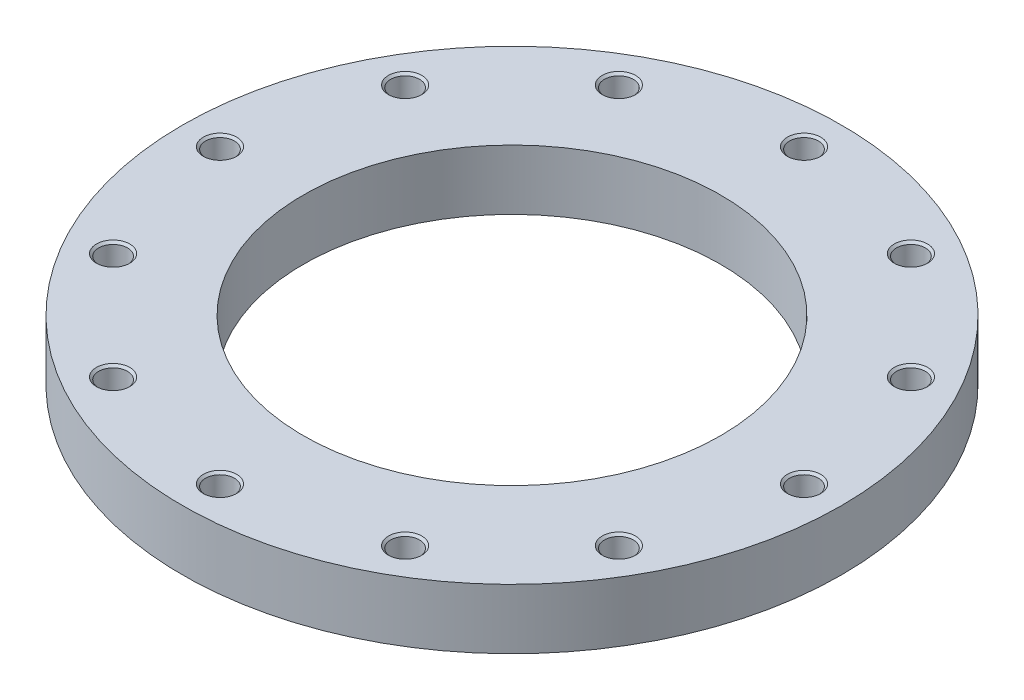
ISO-10303-21;
HEADER;
FILE_DESCRIPTION(('STEP AP214'),'2;1');
FILE_NAME('part.step','',(''),(''),'','','');
FILE_SCHEMA(('AUTOMOTIVE_DESIGN { 1 0 10303 214 1 1 1 1 }'));
ENDSEC;
DATA;
#1=APPLICATION_CONTEXT('core data for automotive mechanical design processes');
#2=APPLICATION_PROTOCOL_DEFINITION('international standard','automotive_design',2000,#1);
#3=PRODUCT_CONTEXT('',#1,'mechanical');
#4=PRODUCT('Part','Part','',(#3));
#5=PRODUCT_RELATED_PRODUCT_CATEGORY('part','',(#4));
#6=PRODUCT_DEFINITION_FORMATION('','',#4);
#7=PRODUCT_DEFINITION_CONTEXT('part definition',#1,'design');
#8=PRODUCT_DEFINITION('design','',#6,#7);
#9=PRODUCT_DEFINITION_SHAPE('','',#8);
#10=(LENGTH_UNIT() NAMED_UNIT(*) SI_UNIT(.MILLI.,.METRE.));
#11=(NAMED_UNIT(*) PLANE_ANGLE_UNIT() SI_UNIT($,.RADIAN.));
#12=(NAMED_UNIT(*) SI_UNIT($,.STERADIAN.) SOLID_ANGLE_UNIT());
#13=UNCERTAINTY_MEASURE_WITH_UNIT(LENGTH_MEASURE(1.E-05),#10,'distance_accuracy_value','');
#14=(GEOMETRIC_REPRESENTATION_CONTEXT(3) GLOBAL_UNCERTAINTY_ASSIGNED_CONTEXT((#13)) GLOBAL_UNIT_ASSIGNED_CONTEXT((#10,
#11,#12)) REPRESENTATION_CONTEXT('',''));
#15=CARTESIAN_POINT('',(0.,0.,0.));
#16=DIRECTION('',(0.,0.,1.));
#17=DIRECTION('',(1.,0.,0.));
#18=AXIS2_PLACEMENT_3D('',#15,#16,#17);
#19=CARTESIAN_POINT('',(0.,18.,0.));
#20=DIRECTION('',(0.,-1.,0.));
#21=DIRECTION('',(1.,0.,0.));
#22=AXIS2_PLACEMENT_3D('',#19,#20,#21);
#23=CYLINDRICAL_SURFACE('',#22,197.5);
#24=CARTESIAN_POINT('',(0.,0.,0.));
#25=DIRECTION('',(0.,1.,0.));
#26=DIRECTION('',(1.,0.,0.));
#27=AXIS2_PLACEMENT_3D('',#24,#25,#26);
#28=CIRCLE('',#27,197.5);
#29=CARTESIAN_POINT('',(197.5,0.,0.));
#30=VERTEX_POINT('',#29);
#31=EDGE_CURVE('E9',#30,#30,#28,.T.);
#32=ORIENTED_EDGE('',*,*,#31,.T.);
#33=EDGE_LOOP('',(#32));
#34=FACE_BOUND('',#33,.T.);
#35=CARTESIAN_POINT('',(0.,36.,0.));
#36=DIRECTION('',(0.,1.,0.));
#37=DIRECTION('',(1.,0.,0.));
#38=AXIS2_PLACEMENT_3D('',#35,#36,#37);
#39=CIRCLE('',#38,197.5);
#40=CARTESIAN_POINT('',(197.5,36.,0.));
#41=VERTEX_POINT('',#40);
#42=EDGE_CURVE('E333',#41,#41,#39,.T.);
#43=ORIENTED_EDGE('',*,*,#42,.F.);
#44=EDGE_LOOP('',(#43));
#45=FACE_BOUND('',#44,.T.);
#46=ADVANCED_FACE('F15',(#34,#45),#23,.T.);
#47=CARTESIAN_POINT('',(161.25,0.,0.));
#48=DIRECTION('',(0.,-1.,0.));
#49=DIRECTION('',(-1.,0.,0.));
#50=AXIS2_PLACEMENT_3D('',#47,#48,#49);
#51=PLANE('',#50);
#52=CARTESIAN_POINT('',(0.,0.,0.));
#53=DIRECTION('',(0.,1.,0.));
#54=DIRECTION('',(1.,0.,0.));
#55=AXIS2_PLACEMENT_3D('',#52,#53,#54);
#56=CIRCLE('',#55,125.);
#57=CARTESIAN_POINT('',(125.,0.,0.));
#58=VERTEX_POINT('',#57);
#59=EDGE_CURVE('E25',#58,#58,#56,.T.);
#60=ORIENTED_EDGE('',*,*,#59,.T.);
#61=EDGE_LOOP('',(#60));
#62=FACE_BOUND('',#61,.T.);
#63=ORIENTED_EDGE('',*,*,#31,.F.);
#64=EDGE_LOOP('',(#63));
#65=FACE_BOUND('',#64,.T.);
#66=ADVANCED_FACE('F489',(#62,#65),#51,.T.);
#67=CARTESIAN_POINT('',(0.,18.,0.));
#68=DIRECTION('',(0.,-1.,0.));
#69=DIRECTION('',(1.,0.,0.));
#70=AXIS2_PLACEMENT_3D('',#67,#68,#69);
#71=CYLINDRICAL_SURFACE('',#70,125.);
#72=CARTESIAN_POINT('',(0.,36.,0.));
#73=DIRECTION('',(0.,1.,0.));
#74=DIRECTION('',(1.,0.,0.));
#75=AXIS2_PLACEMENT_3D('',#72,#73,#74);
#76=CIRCLE('',#75,125.);
#77=CARTESIAN_POINT('',(125.,36.,0.));
#78=VERTEX_POINT('',#77);
#79=EDGE_CURVE('E330',#78,#78,#76,.T.);
#80=ORIENTED_EDGE('',*,*,#79,.T.);
#81=EDGE_LOOP('',(#80));
#82=FACE_BOUND('',#81,.T.);
#83=ORIENTED_EDGE('',*,*,#59,.F.);
#84=EDGE_LOOP('',(#83));
#85=FACE_BOUND('',#84,.T.);
#86=ADVANCED_FACE('F493',(#82,#85),#71,.F.);
#87=CARTESIAN_POINT('',(161.25,36.,0.));
#88=DIRECTION('',(0.,1.,0.));
#89=DIRECTION('',(1.,0.,0.));
#90=AXIS2_PLACEMENT_3D('',#87,#88,#89);
#91=PLANE('',#90);
#92=ORIENTED_EDGE('',*,*,#42,.T.);
#93=EDGE_LOOP('',(#92));
#94=FACE_BOUND('',#93,.T.);
#95=ORIENTED_EDGE('',*,*,#79,.F.);
#96=EDGE_LOOP('',(#95));
#97=FACE_BOUND('',#96,.T.);
#98=CARTESIAN_POINT('',(175.,36.,0.));
#99=DIRECTION('',(0.,-1.,0.));
#100=DIRECTION('',(1.,0.,0.));
#101=AXIS2_PLACEMENT_3D('',#98,#99,#100);
#102=CIRCLE('',#101,10.);
#103=CARTESIAN_POINT('',(185.,36.,0.));
#104=VERTEX_POINT('',#103);
#105=EDGE_CURVE('E246',#104,#104,#102,.T.);
#106=ORIENTED_EDGE('',*,*,#105,.T.);
#107=EDGE_LOOP('',(#106));
#108=FACE_BOUND('',#107,.T.);
#109=CARTESIAN_POINT('',(151.554445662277,36.,-87.5));
#110=DIRECTION('',(0.,-1.,0.));
#111=DIRECTION('',(0.866025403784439,0.,-0.5));
#112=AXIS2_PLACEMENT_3D('',#109,#110,#111);
#113=CIRCLE('',#112,10.);
#114=CARTESIAN_POINT('',(160.214699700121,36.,-92.5));
#115=VERTEX_POINT('',#114);
#116=EDGE_CURVE('E237',#115,#115,#113,.T.);
#117=ORIENTED_EDGE('',*,*,#116,.T.);
#118=EDGE_LOOP('',(#117));
#119=FACE_BOUND('',#118,.T.);
#120=CARTESIAN_POINT('',(87.5,36.,-151.554445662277));
#121=DIRECTION('',(0.,-1.,0.));
#122=DIRECTION('',(0.5,0.,-0.866025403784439));
#123=AXIS2_PLACEMENT_3D('',#120,#121,#122);
#124=CIRCLE('',#123,10.);
#125=CARTESIAN_POINT('',(92.5,36.,-160.214699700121));
#126=VERTEX_POINT('',#125);
#127=EDGE_CURVE('E341',#126,#126,#124,.T.);
#128=ORIENTED_EDGE('',*,*,#127,.T.);
#129=EDGE_LOOP('',(#128));
#130=FACE_BOUND('',#129,.T.);
#131=CARTESIAN_POINT('',(0.,36.,-175.));
#132=DIRECTION('',(0.,-1.,0.));
#133=DIRECTION('',(0.,0.,-1.));
#134=AXIS2_PLACEMENT_3D('',#131,#132,#133);
#135=CIRCLE('',#134,10.);
#136=CARTESIAN_POINT('',(0.,36.,-185.));
#137=VERTEX_POINT('',#136);
#138=EDGE_CURVE('E340',#137,#137,#135,.T.);
#139=ORIENTED_EDGE('',*,*,#138,.T.);
#140=EDGE_LOOP('',(#139));
#141=FACE_BOUND('',#140,.T.);
#142=CARTESIAN_POINT('',(-87.5,36.,-151.554445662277));
#143=DIRECTION('',(0.,-1.,0.));
#144=DIRECTION('',(-0.5,0.,-0.866025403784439));
#145=AXIS2_PLACEMENT_3D('',#142,#143,#144);
#146=CIRCLE('',#145,10.);
#147=CARTESIAN_POINT('',(-92.5,36.,-160.214699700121));
#148=VERTEX_POINT('',#147);
#149=EDGE_CURVE('E319',#148,#148,#146,.T.);
#150=ORIENTED_EDGE('',*,*,#149,.T.);
#151=EDGE_LOOP('',(#150));
#152=FACE_BOUND('',#151,.T.);
#153=CARTESIAN_POINT('',(-151.554445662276,36.,-87.5));
#154=DIRECTION('',(0.,-1.,0.));
#155=DIRECTION('',(-0.866025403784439,0.,-0.5));
#156=AXIS2_PLACEMENT_3D('',#153,#154,#155);
#157=CIRCLE('',#156,10.);
#158=CARTESIAN_POINT('',(-160.214699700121,36.,-92.5));
#159=VERTEX_POINT('',#158);
#160=EDGE_CURVE('E289',#159,#159,#157,.T.);
#161=ORIENTED_EDGE('',*,*,#160,.T.);
#162=EDGE_LOOP('',(#161));
#163=FACE_BOUND('',#162,.T.);
#164=CARTESIAN_POINT('',(-175.,36.,0.));
#165=DIRECTION('',(0.,-1.,0.));
#166=DIRECTION('',(-1.,0.,0.));
#167=AXIS2_PLACEMENT_3D('',#164,#165,#166);
#168=CIRCLE('',#167,10.);
#169=CARTESIAN_POINT('',(-185.,36.,0.));
#170=VERTEX_POINT('',#169);
#171=EDGE_CURVE('E19',#170,#170,#168,.T.);
#172=ORIENTED_EDGE('',*,*,#171,.T.);
#173=EDGE_LOOP('',(#172));
#174=FACE_BOUND('',#173,.T.);
#175=CARTESIAN_POINT('',(-151.554445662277,36.,87.5));
#176=DIRECTION('',(0.,-1.,0.));
#177=DIRECTION('',(-0.866025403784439,0.,0.5));
#178=AXIS2_PLACEMENT_3D('',#175,#176,#177);
#179=CIRCLE('',#178,10.);
#180=CARTESIAN_POINT('',(-160.214699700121,36.,92.5));
#181=VERTEX_POINT('',#180);
#182=EDGE_CURVE('E329',#181,#181,#179,.T.);
#183=ORIENTED_EDGE('',*,*,#182,.T.);
#184=EDGE_LOOP('',(#183));
#185=FACE_BOUND('',#184,.T.);
#186=CARTESIAN_POINT('',(-87.5,36.,151.554445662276));
#187=DIRECTION('',(0.,-1.,0.));
#188=DIRECTION('',(-0.5,0.,0.866025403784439));
#189=AXIS2_PLACEMENT_3D('',#186,#187,#188);
#190=CIRCLE('',#189,10.);
#191=CARTESIAN_POINT('',(-92.5,36.,160.214699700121));
#192=VERTEX_POINT('',#191);
#193=EDGE_CURVE('E299',#192,#192,#190,.T.);
#194=ORIENTED_EDGE('',*,*,#193,.T.);
#195=EDGE_LOOP('',(#194));
#196=FACE_BOUND('',#195,.T.);
#197=CARTESIAN_POINT('',(0.,36.,175.));
#198=DIRECTION('',(0.,-1.,0.));
#199=DIRECTION('',(0.,0.,1.));
#200=AXIS2_PLACEMENT_3D('',#197,#198,#199);
#201=CIRCLE('',#200,10.);
#202=CARTESIAN_POINT('',(0.,36.,185.));
#203=VERTEX_POINT('',#202);
#204=EDGE_CURVE('E252',#203,#203,#201,.T.);
#205=ORIENTED_EDGE('',*,*,#204,.T.);
#206=EDGE_LOOP('',(#205));
#207=FACE_BOUND('',#206,.T.);
#208=CARTESIAN_POINT('',(87.5,36.,151.554445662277));
#209=DIRECTION('',(0.,-1.,0.));
#210=DIRECTION('',(0.5,0.,0.866025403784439));
#211=AXIS2_PLACEMENT_3D('',#208,#209,#210);
#212=CIRCLE('',#211,10.);
#213=CARTESIAN_POINT('',(92.5,36.,160.214699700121));
#214=VERTEX_POINT('',#213);
#215=EDGE_CURVE('E263',#214,#214,#212,.T.);
#216=ORIENTED_EDGE('',*,*,#215,.T.);
#217=EDGE_LOOP('',(#216));
#218=FACE_BOUND('',#217,.T.);
#219=CARTESIAN_POINT('',(151.554445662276,36.,87.5));
#220=DIRECTION('',(0.,-1.,0.));
#221=DIRECTION('',(0.866025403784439,0.,0.5));
#222=AXIS2_PLACEMENT_3D('',#219,#220,#221);
#223=CIRCLE('',#222,10.);
#224=CARTESIAN_POINT('',(160.214699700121,36.,92.5));
#225=VERTEX_POINT('',#224);
#226=EDGE_CURVE('E307',#225,#225,#223,.T.);
#227=ORIENTED_EDGE('',*,*,#226,.T.);
#228=EDGE_LOOP('',(#227));
#229=FACE_BOUND('',#228,.T.);
#230=ADVANCED_FACE('F433',(#94,#97,#108,#119,#130,#141,#152,#163,#174,#185,#196,#207,#218,#229),
#91,.T.);
#231=CARTESIAN_POINT('',(175.,5.50386219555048,0.));
#232=DIRECTION('',(0.,1.,0.));
#233=DIRECTION('',(1.,0.,0.));
#234=AXIS2_PLACEMENT_3D('',#231,#232,#233);
#235=CONICAL_SURFACE('',#234,4.3234375,1.0471975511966);
#236=CARTESIAN_POINT('',(175.,8.,0.));
#237=DIRECTION('',(0.,-1.,0.));
#238=DIRECTION('',(1.,0.,0.));
#239=AXIS2_PLACEMENT_3D('',#236,#237,#238);
#240=CIRCLE('',#239,8.646875);
#241=CARTESIAN_POINT('',(183.646875,8.,0.));
#242=VERTEX_POINT('',#241);
#243=EDGE_CURVE('E257',#242,#242,#240,.T.);
#244=ORIENTED_EDGE('',*,*,#243,.F.);
#245=EDGE_LOOP('',(#244));
#246=FACE_BOUND('',#245,.T.);
#247=CARTESIAN_POINT('',(175.,3.00772439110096,0.));
#248=VERTEX_POINT('',#247);
#249=VERTEX_LOOP('',#248);
#250=FACE_BOUND('',#249,.T.);
#251=ADVANCED_FACE('F582',(#246,#250),#235,.F.);
#252=CARTESIAN_POINT('',(175.,11.3234375,0.));
#253=DIRECTION('',(0.,1.,0.));
#254=DIRECTION('',(1.,0.,0.));
#255=AXIS2_PLACEMENT_3D('',#252,#253,#254);
#256=CYLINDRICAL_SURFACE('',#255,8.646875);
#257=CARTESIAN_POINT('',(175.,14.646875,0.));
#258=DIRECTION('',(0.,-1.,0.));
#259=DIRECTION('',(1.,0.,0.));
#260=AXIS2_PLACEMENT_3D('',#257,#258,#259);
#261=CIRCLE('',#260,8.646875);
#262=CARTESIAN_POINT('',(183.646875,14.646875,0.));
#263=VERTEX_POINT('',#262);
#264=EDGE_CURVE('E255',#263,#263,#261,.T.);
#265=ORIENTED_EDGE('',*,*,#264,.F.);
#266=EDGE_LOOP('',(#265));
#267=FACE_BOUND('',#266,.T.);
#268=ORIENTED_EDGE('',*,*,#243,.T.);
#269=EDGE_LOOP('',(#268));
#270=FACE_BOUND('',#269,.T.);
#271=ADVANCED_FACE('F585',(#267,#270),#256,.F.);
#272=CARTESIAN_POINT('',(175.,15.3234375,0.));
#273=DIRECTION('',(0.,1.,0.));
#274=DIRECTION('',(1.,0.,0.));
#275=AXIS2_PLACEMENT_3D('',#272,#273,#274);
#276=CONICAL_SURFACE('',#275,9.3234375,0.785398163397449);
#277=CARTESIAN_POINT('',(175.,16.,0.));
#278=DIRECTION('',(0.,-1.,0.));
#279=DIRECTION('',(1.,0.,0.));
#280=AXIS2_PLACEMENT_3D('',#277,#278,#279);
#281=CIRCLE('',#280,10.);
#282=CARTESIAN_POINT('',(185.,16.,0.));
#283=VERTEX_POINT('',#282);
#284=EDGE_CURVE('E258',#283,#283,#281,.T.);
#285=ORIENTED_EDGE('',*,*,#284,.F.);
#286=EDGE_LOOP('',(#285));
#287=FACE_BOUND('',#286,.T.);
#288=ORIENTED_EDGE('',*,*,#264,.T.);
#289=EDGE_LOOP('',(#288));
#290=FACE_BOUND('',#289,.T.);
#291=ADVANCED_FACE('F602',(#287,#290),#276,.F.);
#292=CARTESIAN_POINT('',(184.3234375,16.,0.));
#293=DIRECTION('',(0.,1.,0.));
#294=DIRECTION('',(-1.,0.,0.));
#295=AXIS2_PLACEMENT_3D('',#292,#293,#294);
#296=PLANE('',#295);
#297=CARTESIAN_POINT('',(175.,16.,0.));
#298=DIRECTION('',(0.,-1.,0.));
#299=DIRECTION('',(1.,0.,0.));
#300=AXIS2_PLACEMENT_3D('',#297,#298,#299);
#301=CIRCLE('',#300,8.646875);
#302=CARTESIAN_POINT('',(183.646875,16.,0.));
#303=VERTEX_POINT('',#302);
#304=EDGE_CURVE('E360',#303,#303,#301,.T.);
#305=ORIENTED_EDGE('',*,*,#304,.F.);
#306=EDGE_LOOP('',(#305));
#307=FACE_BOUND('',#306,.T.);
#308=ORIENTED_EDGE('',*,*,#284,.T.);
#309=EDGE_LOOP('',(#308));
#310=FACE_BOUND('',#309,.T.);
#311=ADVANCED_FACE('F597',(#307,#310),#296,.F.);
#312=CARTESIAN_POINT('',(175.,25.3234375,0.));
#313=DIRECTION('',(0.,1.,0.));
#314=DIRECTION('',(1.,0.,0.));
#315=AXIS2_PLACEMENT_3D('',#312,#313,#314);
#316=CYLINDRICAL_SURFACE('',#315,8.646875);
#317=CARTESIAN_POINT('',(175.,34.646875,0.));
#318=DIRECTION('',(0.,-1.,0.));
#319=DIRECTION('',(1.,0.,0.));
#320=AXIS2_PLACEMENT_3D('',#317,#318,#319);
#321=CIRCLE('',#320,8.646875);
#322=CARTESIAN_POINT('',(183.646875,34.646875,0.));
#323=VERTEX_POINT('',#322);
#324=EDGE_CURVE('E311',#323,#323,#321,.T.);
#325=ORIENTED_EDGE('',*,*,#324,.F.);
#326=EDGE_LOOP('',(#325));
#327=FACE_BOUND('',#326,.T.);
#328=ORIENTED_EDGE('',*,*,#304,.T.);
#329=EDGE_LOOP('',(#328));
#330=FACE_BOUND('',#329,.T.);
#331=ADVANCED_FACE('F510',(#327,#330),#316,.F.);
#332=CARTESIAN_POINT('',(175.,35.3234375,0.));
#333=DIRECTION('',(0.,1.,0.));
#334=DIRECTION('',(1.,0.,0.));
#335=AXIS2_PLACEMENT_3D('',#332,#333,#334);
#336=CONICAL_SURFACE('',#335,9.3234375,0.785398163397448);
#337=ORIENTED_EDGE('',*,*,#105,.F.);
#338=EDGE_LOOP('',(#337));
#339=FACE_BOUND('',#338,.T.);
#340=ORIENTED_EDGE('',*,*,#324,.T.);
#341=EDGE_LOOP('',(#340));
#342=FACE_BOUND('',#341,.T.);
#343=ADVANCED_FACE('F506',(#339,#342),#336,.F.);
#344=CARTESIAN_POINT('',(151.554445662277,5.50386219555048,-87.5));
#345=DIRECTION('',(0.,1.,0.));
#346=DIRECTION('',(0.866025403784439,0.,-0.5));
#347=AXIS2_PLACEMENT_3D('',#344,#345,#346);
#348=CONICAL_SURFACE('',#347,4.3234375,1.0471975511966);
#349=CARTESIAN_POINT('',(151.554445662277,8.,-87.5));
#350=DIRECTION('',(0.,-1.,0.));
#351=DIRECTION('',(0.866025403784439,0.,-0.5));
#352=AXIS2_PLACEMENT_3D('',#349,#350,#351);
#353=CIRCLE('',#352,8.646875);
#354=CARTESIAN_POINT('',(159.042859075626,8.,-91.8234375));
#355=VERTEX_POINT('',#354);
#356=EDGE_CURVE('E313',#355,#355,#353,.T.);
#357=ORIENTED_EDGE('',*,*,#356,.F.);
#358=EDGE_LOOP('',(#357));
#359=FACE_BOUND('',#358,.T.);
#360=CARTESIAN_POINT('',(151.554445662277,3.00772439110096,-87.5));
#361=VERTEX_POINT('',#360);
#362=VERTEX_LOOP('',#361);
#363=FACE_BOUND('',#362,.T.);
#364=ADVANCED_FACE('F509',(#359,#363),#348,.F.);
#365=CARTESIAN_POINT('',(151.554445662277,11.3234375,-87.5));
#366=DIRECTION('',(0.,1.,0.));
#367=DIRECTION('',(0.866025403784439,0.,-0.5));
#368=AXIS2_PLACEMENT_3D('',#365,#366,#367);
#369=CYLINDRICAL_SURFACE('',#368,8.646875);
#370=CARTESIAN_POINT('',(151.554445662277,14.646875,-87.5));
#371=DIRECTION('',(0.,-1.,0.));
#372=DIRECTION('',(0.866025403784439,0.,-0.5));
#373=AXIS2_PLACEMENT_3D('',#370,#371,#372);
#374=CIRCLE('',#373,8.646875);
#375=CARTESIAN_POINT('',(159.042859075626,14.646875,-91.8234375));
#376=VERTEX_POINT('',#375);
#377=EDGE_CURVE('E324',#376,#376,#374,.T.);
#378=ORIENTED_EDGE('',*,*,#377,.F.);
#379=EDGE_LOOP('',(#378));
#380=FACE_BOUND('',#379,.T.);
#381=ORIENTED_EDGE('',*,*,#356,.T.);
#382=EDGE_LOOP('',(#381));
#383=FACE_BOUND('',#382,.T.);
#384=ADVANCED_FACE('F1003',(#380,#383),#369,.F.);
#385=CARTESIAN_POINT('',(151.554445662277,15.3234375,-87.5));
#386=DIRECTION('',(0.,1.,0.));
#387=DIRECTION('',(0.866025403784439,0.,-0.5));
#388=AXIS2_PLACEMENT_3D('',#385,#386,#387);
#389=CONICAL_SURFACE('',#388,9.3234375,0.785398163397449);
#390=CARTESIAN_POINT('',(151.554445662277,16.,-87.5));
#391=DIRECTION('',(0.,-1.,0.));
#392=DIRECTION('',(0.866025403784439,0.,-0.5));
#393=AXIS2_PLACEMENT_3D('',#390,#391,#392);
#394=CIRCLE('',#393,10.);
#395=CARTESIAN_POINT('',(160.214699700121,16.,-92.5));
#396=VERTEX_POINT('',#395);
#397=EDGE_CURVE('E296',#396,#396,#394,.T.);
#398=ORIENTED_EDGE('',*,*,#397,.F.);
#399=EDGE_LOOP('',(#398));
#400=FACE_BOUND('',#399,.T.);
#401=ORIENTED_EDGE('',*,*,#377,.T.);
#402=EDGE_LOOP('',(#401));
#403=FACE_BOUND('',#402,.T.);
#404=ADVANCED_FACE('F1000',(#400,#403),#389,.F.);
#405=CARTESIAN_POINT('',(159.628779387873,16.,-92.16171875));
#406=DIRECTION('',(0.,1.,0.));
#407=DIRECTION('',(-0.866025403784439,0.,0.5));
#408=AXIS2_PLACEMENT_3D('',#405,#406,#407);
#409=PLANE('',#408);
#410=CARTESIAN_POINT('',(151.554445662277,16.,-87.5));
#411=DIRECTION('',(0.,-1.,0.));
#412=DIRECTION('',(0.866025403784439,0.,-0.5));
#413=AXIS2_PLACEMENT_3D('',#410,#411,#412);
#414=CIRCLE('',#413,8.646875);
#415=CARTESIAN_POINT('',(159.042859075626,16.,-91.8234375));
#416=VERTEX_POINT('',#415);
#417=EDGE_CURVE('E240',#416,#416,#414,.T.);
#418=ORIENTED_EDGE('',*,*,#417,.F.);
#419=EDGE_LOOP('',(#418));
#420=FACE_BOUND('',#419,.T.);
#421=ORIENTED_EDGE('',*,*,#397,.T.);
#422=EDGE_LOOP('',(#421));
#423=FACE_BOUND('',#422,.T.);
#424=ADVANCED_FACE('F648',(#420,#423),#409,.F.);
#425=CARTESIAN_POINT('',(151.554445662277,25.3234375,-87.5));
#426=DIRECTION('',(0.,1.,0.));
#427=DIRECTION('',(0.866025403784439,0.,-0.5));
#428=AXIS2_PLACEMENT_3D('',#425,#426,#427);
#429=CYLINDRICAL_SURFACE('',#428,8.646875);
#430=CARTESIAN_POINT('',(151.554445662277,34.646875,-87.5));
#431=DIRECTION('',(0.,-1.,0.));
#432=DIRECTION('',(0.866025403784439,0.,-0.5));
#433=AXIS2_PLACEMENT_3D('',#430,#431,#432);
#434=CIRCLE('',#433,8.646875);
#435=CARTESIAN_POINT('',(159.042859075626,34.646875,-91.8234375));
#436=VERTEX_POINT('',#435);
#437=EDGE_CURVE('E234',#436,#436,#434,.T.);
#438=ORIENTED_EDGE('',*,*,#437,.F.);
#439=EDGE_LOOP('',(#438));
#440=FACE_BOUND('',#439,.T.);
#441=ORIENTED_EDGE('',*,*,#417,.T.);
#442=EDGE_LOOP('',(#441));
#443=FACE_BOUND('',#442,.T.);
#444=ADVANCED_FACE('F645',(#440,#443),#429,.F.);
#445=CARTESIAN_POINT('',(151.554445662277,35.3234375,-87.5));
#446=DIRECTION('',(0.,1.,0.));
#447=DIRECTION('',(0.866025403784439,0.,-0.5));
#448=AXIS2_PLACEMENT_3D('',#445,#446,#447);
#449=CONICAL_SURFACE('',#448,9.3234375,0.785398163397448);
#450=ORIENTED_EDGE('',*,*,#116,.F.);
#451=EDGE_LOOP('',(#450));
#452=FACE_BOUND('',#451,.T.);
#453=ORIENTED_EDGE('',*,*,#437,.T.);
#454=EDGE_LOOP('',(#453));
#455=FACE_BOUND('',#454,.T.);
#456=ADVANCED_FACE('F235',(#452,#455),#449,.F.);
#457=CARTESIAN_POINT('',(87.5,5.50386219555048,-151.554445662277));
#458=DIRECTION('',(0.,1.,0.));
#459=DIRECTION('',(0.5,0.,-0.866025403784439));
#460=AXIS2_PLACEMENT_3D('',#457,#458,#459);
#461=CONICAL_SURFACE('',#460,4.3234375,1.0471975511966);
#462=CARTESIAN_POINT('',(87.5,8.,-151.554445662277));
#463=DIRECTION('',(0.,-1.,0.));
#464=DIRECTION('',(0.5,0.,-0.866025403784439));
#465=AXIS2_PLACEMENT_3D('',#462,#463,#464);
#466=CIRCLE('',#465,8.646875);
#467=CARTESIAN_POINT('',(91.8234375,8.,-159.042859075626));
#468=VERTEX_POINT('',#467);
#469=EDGE_CURVE('E238',#468,#468,#466,.T.);
#470=ORIENTED_EDGE('',*,*,#469,.F.);
#471=EDGE_LOOP('',(#470));
#472=FACE_BOUND('',#471,.T.);
#473=CARTESIAN_POINT('',(87.5,3.00772439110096,-151.554445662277));
#474=VERTEX_POINT('',#473);
#475=VERTEX_LOOP('',#474);
#476=FACE_BOUND('',#475,.T.);
#477=ADVANCED_FACE('F643',(#472,#476),#461,.F.);
#478=CARTESIAN_POINT('',(87.5,11.3234375,-151.554445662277));
#479=DIRECTION('',(0.,1.,0.));
#480=DIRECTION('',(0.5,0.,-0.866025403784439));
#481=AXIS2_PLACEMENT_3D('',#478,#479,#480);
#482=CYLINDRICAL_SURFACE('',#481,8.646875);
#483=CARTESIAN_POINT('',(87.5,14.646875,-151.554445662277));
#484=DIRECTION('',(0.,-1.,0.));
#485=DIRECTION('',(0.5,0.,-0.866025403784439));
#486=AXIS2_PLACEMENT_3D('',#483,#484,#485);
#487=CIRCLE('',#486,8.646875);
#488=CARTESIAN_POINT('',(91.8234375,14.646875,-159.042859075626));
#489=VERTEX_POINT('',#488);
#490=EDGE_CURVE('E242',#489,#489,#487,.T.);
#491=ORIENTED_EDGE('',*,*,#490,.F.);
#492=EDGE_LOOP('',(#491));
#493=FACE_BOUND('',#492,.T.);
#494=ORIENTED_EDGE('',*,*,#469,.T.);
#495=EDGE_LOOP('',(#494));
#496=FACE_BOUND('',#495,.T.);
#497=ADVANCED_FACE('F557',(#493,#496),#482,.F.);
#498=CARTESIAN_POINT('',(87.5,15.3234375,-151.554445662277));
#499=DIRECTION('',(0.,1.,0.));
#500=DIRECTION('',(0.5,0.,-0.866025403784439));
#501=AXIS2_PLACEMENT_3D('',#498,#499,#500);
#502=CONICAL_SURFACE('',#501,9.3234375,0.785398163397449);
#503=CARTESIAN_POINT('',(87.5,16.,-151.554445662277));
#504=DIRECTION('',(0.,-1.,0.));
#505=DIRECTION('',(0.5,0.,-0.866025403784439));
#506=AXIS2_PLACEMENT_3D('',#503,#504,#505);
#507=CIRCLE('',#506,10.);
#508=CARTESIAN_POINT('',(92.5,16.,-160.214699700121));
#509=VERTEX_POINT('',#508);
#510=EDGE_CURVE('E345',#509,#509,#507,.T.);
#511=ORIENTED_EDGE('',*,*,#510,.F.);
#512=EDGE_LOOP('',(#511));
#513=FACE_BOUND('',#512,.T.);
#514=ORIENTED_EDGE('',*,*,#490,.T.);
#515=EDGE_LOOP('',(#514));
#516=FACE_BOUND('',#515,.T.);
#517=ADVANCED_FACE('F553',(#513,#516),#502,.F.);
#518=CARTESIAN_POINT('',(92.16171875,16.,-159.628779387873));
#519=DIRECTION('',(0.,1.,0.));
#520=DIRECTION('',(-0.5,0.,0.866025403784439));
#521=AXIS2_PLACEMENT_3D('',#518,#519,#520);
#522=PLANE('',#521);
#523=CARTESIAN_POINT('',(87.5,16.,-151.554445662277));
#524=DIRECTION('',(0.,-1.,0.));
#525=DIRECTION('',(0.5,0.,-0.866025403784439));
#526=AXIS2_PLACEMENT_3D('',#523,#524,#525);
#527=CIRCLE('',#526,8.646875);
#528=CARTESIAN_POINT('',(91.8234375,16.,-159.042859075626));
#529=VERTEX_POINT('',#528);
#530=EDGE_CURVE('E344',#529,#529,#527,.T.);
#531=ORIENTED_EDGE('',*,*,#530,.F.);
#532=EDGE_LOOP('',(#531));
#533=FACE_BOUND('',#532,.T.);
#534=ORIENTED_EDGE('',*,*,#510,.T.);
#535=EDGE_LOOP('',(#534));
#536=FACE_BOUND('',#535,.T.);
#537=ADVANCED_FACE('F556',(#533,#536),#522,.F.);
#538=CARTESIAN_POINT('',(87.5,25.3234375,-151.554445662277));
#539=DIRECTION('',(0.,1.,0.));
#540=DIRECTION('',(0.5,0.,-0.866025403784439));
#541=AXIS2_PLACEMENT_3D('',#538,#539,#540);
#542=CYLINDRICAL_SURFACE('',#541,8.646875);
#543=CARTESIAN_POINT('',(87.5,34.646875,-151.554445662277));
#544=DIRECTION('',(0.,-1.,0.));
#545=DIRECTION('',(0.5,0.,-0.866025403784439));
#546=AXIS2_PLACEMENT_3D('',#543,#544,#545);
#547=CIRCLE('',#546,8.646875);
#548=CARTESIAN_POINT('',(91.8234375,34.646875,-159.042859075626));
#549=VERTEX_POINT('',#548);
#550=EDGE_CURVE('E306',#549,#549,#547,.T.);
#551=ORIENTED_EDGE('',*,*,#550,.F.);
#552=EDGE_LOOP('',(#551));
#553=FACE_BOUND('',#552,.T.);
#554=ORIENTED_EDGE('',*,*,#530,.T.);
#555=EDGE_LOOP('',(#554));
#556=FACE_BOUND('',#555,.T.);
#557=ADVANCED_FACE('F17',(#553,#556),#542,.F.);
#558=CARTESIAN_POINT('',(87.5,35.3234375,-151.554445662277));
#559=DIRECTION('',(0.,1.,0.));
#560=DIRECTION('',(0.5,0.,-0.866025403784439));
#561=AXIS2_PLACEMENT_3D('',#558,#559,#560);
#562=CONICAL_SURFACE('',#561,9.3234375,0.785398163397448);
#563=ORIENTED_EDGE('',*,*,#127,.F.);
#564=EDGE_LOOP('',(#563));
#565=FACE_BOUND('',#564,.T.);
#566=ORIENTED_EDGE('',*,*,#550,.T.);
#567=EDGE_LOOP('',(#566));
#568=FACE_BOUND('',#567,.T.);
#569=ADVANCED_FACE('F551',(#565,#568),#562,.F.);
#570=CARTESIAN_POINT('',(0.,5.50386219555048,-175.));
#571=DIRECTION('',(0.,1.,0.));
#572=DIRECTION('',(0.,0.,-1.));
#573=AXIS2_PLACEMENT_3D('',#570,#571,#572);
#574=CONICAL_SURFACE('',#573,4.3234375,1.0471975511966);
#575=CARTESIAN_POINT('',(0.,8.,-175.));
#576=DIRECTION('',(0.,-1.,0.));
#577=DIRECTION('',(0.,0.,-1.));
#578=AXIS2_PLACEMENT_3D('',#575,#576,#577);
#579=CIRCLE('',#578,8.646875);
#580=CARTESIAN_POINT('',(0.,8.,-183.646875));
#581=VERTEX_POINT('',#580);
#582=EDGE_CURVE('E282',#581,#581,#579,.T.);
#583=ORIENTED_EDGE('',*,*,#582,.F.);
#584=EDGE_LOOP('',(#583));
#585=FACE_BOUND('',#584,.T.);
#586=CARTESIAN_POINT('',(0.,3.00772439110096,-175.));
#587=VERTEX_POINT('',#586);
#588=VERTEX_LOOP('',#587);
#589=FACE_BOUND('',#588,.T.);
#590=ADVANCED_FACE('F547',(#585,#589),#574,.F.);
#591=CARTESIAN_POINT('',(0.,11.3234375,-175.));
#592=DIRECTION('',(0.,1.,0.));
#593=DIRECTION('',(0.,0.,-1.));
#594=AXIS2_PLACEMENT_3D('',#591,#592,#593);
#595=CYLINDRICAL_SURFACE('',#594,8.646875);
#596=CARTESIAN_POINT('',(0.,14.646875,-175.));
#597=DIRECTION('',(0.,-1.,0.));
#598=DIRECTION('',(0.,0.,-1.));
#599=AXIS2_PLACEMENT_3D('',#596,#597,#598);
#600=CIRCLE('',#599,8.646875);
#601=CARTESIAN_POINT('',(0.,14.646875,-183.646875));
#602=VERTEX_POINT('',#601);
#603=EDGE_CURVE('E281',#602,#602,#600,.T.);
#604=ORIENTED_EDGE('',*,*,#603,.F.);
#605=EDGE_LOOP('',(#604));
#606=FACE_BOUND('',#605,.T.);
#607=ORIENTED_EDGE('',*,*,#582,.T.);
#608=EDGE_LOOP('',(#607));
#609=FACE_BOUND('',#608,.T.);
#610=ADVANCED_FACE('F550',(#606,#609),#595,.F.);
#611=CARTESIAN_POINT('',(0.,15.3234375,-175.));
#612=DIRECTION('',(0.,1.,0.));
#613=DIRECTION('',(0.,0.,-1.));
#614=AXIS2_PLACEMENT_3D('',#611,#612,#613);
#615=CONICAL_SURFACE('',#614,9.3234375,0.785398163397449);
#616=CARTESIAN_POINT('',(0.,16.,-175.));
#617=DIRECTION('',(0.,-1.,0.));
#618=DIRECTION('',(0.,0.,-1.));
#619=AXIS2_PLACEMENT_3D('',#616,#617,#618);
#620=CIRCLE('',#619,10.);
#621=CARTESIAN_POINT('',(0.,16.,-185.));
#622=VERTEX_POINT('',#621);
#623=EDGE_CURVE('E283',#622,#622,#620,.T.);
#624=ORIENTED_EDGE('',*,*,#623,.F.);
#625=EDGE_LOOP('',(#624));
#626=FACE_BOUND('',#625,.T.);
#627=ORIENTED_EDGE('',*,*,#603,.T.);
#628=EDGE_LOOP('',(#627));
#629=FACE_BOUND('',#628,.T.);
#630=ADVANCED_FACE('F516',(#626,#629),#615,.F.);
#631=CARTESIAN_POINT('',(0.,16.,-184.3234375));
#632=DIRECTION('',(0.,1.,0.));
#633=DIRECTION('',(0.,0.,1.));
#634=AXIS2_PLACEMENT_3D('',#631,#632,#633);
#635=PLANE('',#634);
#636=CARTESIAN_POINT('',(0.,16.,-175.));
#637=DIRECTION('',(0.,-1.,0.));
#638=DIRECTION('',(0.,0.,-1.));
#639=AXIS2_PLACEMENT_3D('',#636,#637,#638);
#640=CIRCLE('',#639,8.646875);
#641=CARTESIAN_POINT('',(0.,16.,-183.646875));
#642=VERTEX_POINT('',#641);
#643=EDGE_CURVE('E364',#642,#642,#640,.T.);
#644=ORIENTED_EDGE('',*,*,#643,.F.);
#645=EDGE_LOOP('',(#644));
#646=FACE_BOUND('',#645,.T.);
#647=ORIENTED_EDGE('',*,*,#623,.T.);
#648=EDGE_LOOP('',(#647));
#649=FACE_BOUND('',#648,.T.);
#650=ADVANCED_FACE('F512',(#646,#649),#635,.F.);
#651=CARTESIAN_POINT('',(0.,25.3234375,-175.));
#652=DIRECTION('',(0.,1.,0.));
#653=DIRECTION('',(0.,0.,-1.));
#654=AXIS2_PLACEMENT_3D('',#651,#652,#653);
#655=CYLINDRICAL_SURFACE('',#654,8.646875);
#656=CARTESIAN_POINT('',(0.,34.646875,-175.));
#657=DIRECTION('',(0.,-1.,0.));
#658=DIRECTION('',(0.,0.,-1.));
#659=AXIS2_PLACEMENT_3D('',#656,#657,#658);
#660=CIRCLE('',#659,8.646875);
#661=CARTESIAN_POINT('',(0.,34.646875,-183.646875));
#662=VERTEX_POINT('',#661);
#663=EDGE_CURVE('E337',#662,#662,#660,.T.);
#664=ORIENTED_EDGE('',*,*,#663,.F.);
#665=EDGE_LOOP('',(#664));
#666=FACE_BOUND('',#665,.T.);
#667=ORIENTED_EDGE('',*,*,#643,.T.);
#668=EDGE_LOOP('',(#667));
#669=FACE_BOUND('',#668,.T.);
#670=ADVANCED_FACE('F515',(#666,#669),#655,.F.);
#671=CARTESIAN_POINT('',(0.,35.3234375,-175.));
#672=DIRECTION('',(0.,1.,0.));
#673=DIRECTION('',(0.,0.,-1.));
#674=AXIS2_PLACEMENT_3D('',#671,#672,#673);
#675=CONICAL_SURFACE('',#674,9.3234375,0.785398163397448);
#676=ORIENTED_EDGE('',*,*,#138,.F.);
#677=EDGE_LOOP('',(#676));
#678=FACE_BOUND('',#677,.T.);
#679=ORIENTED_EDGE('',*,*,#663,.T.);
#680=EDGE_LOOP('',(#679));
#681=FACE_BOUND('',#680,.T.);
#682=ADVANCED_FACE('F634',(#678,#681),#675,.F.);
#683=CARTESIAN_POINT('',(-87.5,5.50386219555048,-151.554445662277));
#684=DIRECTION('',(0.,1.,0.));
#685=DIRECTION('',(-0.5,0.,-0.866025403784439));
#686=AXIS2_PLACEMENT_3D('',#683,#684,#685);
#687=CONICAL_SURFACE('',#686,4.3234375,1.0471975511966);
#688=CARTESIAN_POINT('',(-87.5,8.,-151.554445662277));
#689=DIRECTION('',(0.,-1.,0.));
#690=DIRECTION('',(-0.5,0.,-0.866025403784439));
#691=AXIS2_PLACEMENT_3D('',#688,#689,#690);
#692=CIRCLE('',#691,8.646875);
#693=CARTESIAN_POINT('',(-91.8234375,8.,-159.042859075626));
#694=VERTEX_POINT('',#693);
#695=EDGE_CURVE('E287',#694,#694,#692,.T.);
#696=ORIENTED_EDGE('',*,*,#695,.F.);
#697=EDGE_LOOP('',(#696));
#698=FACE_BOUND('',#697,.T.);
#699=CARTESIAN_POINT('',(-87.5,3.00772439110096,-151.554445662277));
#700=VERTEX_POINT('',#699);
#701=VERTEX_LOOP('',#700);
#702=FACE_BOUND('',#701,.T.);
#703=ADVANCED_FACE('F1006',(#698,#702),#687,.F.);
#704=CARTESIAN_POINT('',(-87.5,11.3234375,-151.554445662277));
#705=DIRECTION('',(0.,1.,0.));
#706=DIRECTION('',(-0.5,0.,-0.866025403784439));
#707=AXIS2_PLACEMENT_3D('',#704,#705,#706);
#708=CYLINDRICAL_SURFACE('',#707,8.646875);
#709=CARTESIAN_POINT('',(-87.5,14.646875,-151.554445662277));
#710=DIRECTION('',(0.,-1.,0.));
#711=DIRECTION('',(-0.5,0.,-0.866025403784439));
#712=AXIS2_PLACEMENT_3D('',#709,#710,#711);
#713=CIRCLE('',#712,8.646875);
#714=CARTESIAN_POINT('',(-91.8234375,14.646875,-159.042859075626));
#715=VERTEX_POINT('',#714);
#716=EDGE_CURVE('E285',#715,#715,#713,.T.);
#717=ORIENTED_EDGE('',*,*,#716,.F.);
#718=EDGE_LOOP('',(#717));
#719=FACE_BOUND('',#718,.T.);
#720=ORIENTED_EDGE('',*,*,#695,.T.);
#721=EDGE_LOOP('',(#720));
#722=FACE_BOUND('',#721,.T.);
#723=ADVANCED_FACE('F658',(#719,#722),#708,.F.);
#724=CARTESIAN_POINT('',(-87.5,15.3234375,-151.554445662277));
#725=DIRECTION('',(0.,1.,0.));
#726=DIRECTION('',(-0.5,0.,-0.866025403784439));
#727=AXIS2_PLACEMENT_3D('',#724,#725,#726);
#728=CONICAL_SURFACE('',#727,9.3234375,0.785398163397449);
#729=CARTESIAN_POINT('',(-87.5,16.,-151.554445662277));
#730=DIRECTION('',(0.,-1.,0.));
#731=DIRECTION('',(-0.5,0.,-0.866025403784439));
#732=AXIS2_PLACEMENT_3D('',#729,#730,#731);
#733=CIRCLE('',#732,10.);
#734=CARTESIAN_POINT('',(-92.5,16.,-160.214699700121));
#735=VERTEX_POINT('',#734);
#736=EDGE_CURVE('E288',#735,#735,#733,.T.);
#737=ORIENTED_EDGE('',*,*,#736,.F.);
#738=EDGE_LOOP('',(#737));
#739=FACE_BOUND('',#738,.T.);
#740=ORIENTED_EDGE('',*,*,#716,.T.);
#741=EDGE_LOOP('',(#740));
#742=FACE_BOUND('',#741,.T.);
#743=ADVANCED_FACE('F655',(#739,#742),#728,.F.);
#744=CARTESIAN_POINT('',(-92.16171875,16.,-159.628779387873));
#745=DIRECTION('',(0.,1.,0.));
#746=DIRECTION('',(0.5,0.,0.866025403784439));
#747=AXIS2_PLACEMENT_3D('',#744,#745,#746);
#748=PLANE('',#747);
#749=CARTESIAN_POINT('',(-87.5,16.,-151.554445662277));
#750=DIRECTION('',(0.,-1.,0.));
#751=DIRECTION('',(-0.5,0.,-0.866025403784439));
#752=AXIS2_PLACEMENT_3D('',#749,#750,#751);
#753=CIRCLE('',#752,8.646875);
#754=CARTESIAN_POINT('',(-91.8234375,16.,-159.042859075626));
#755=VERTEX_POINT('',#754);
#756=EDGE_CURVE('E318',#755,#755,#753,.T.);
#757=ORIENTED_EDGE('',*,*,#756,.F.);
#758=EDGE_LOOP('',(#757));
#759=FACE_BOUND('',#758,.T.);
#760=ORIENTED_EDGE('',*,*,#736,.T.);
#761=EDGE_LOOP('',(#760));
#762=FACE_BOUND('',#761,.T.);
#763=ADVANCED_FACE('F639',(#759,#762),#748,.F.);
#764=CARTESIAN_POINT('',(-87.5,25.3234375,-151.554445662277));
#765=DIRECTION('',(0.,1.,0.));
#766=DIRECTION('',(-0.5,0.,-0.866025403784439));
#767=AXIS2_PLACEMENT_3D('',#764,#765,#766);
#768=CYLINDRICAL_SURFACE('',#767,8.646875);
#769=CARTESIAN_POINT('',(-87.5,34.646875,-151.554445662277));
#770=DIRECTION('',(0.,-1.,0.));
#771=DIRECTION('',(-0.5,0.,-0.866025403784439));
#772=AXIS2_PLACEMENT_3D('',#769,#770,#771);
#773=CIRCLE('',#772,8.646875);
#774=CARTESIAN_POINT('',(-91.8234375,34.646875,-159.042859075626));
#775=VERTEX_POINT('',#774);
#776=EDGE_CURVE('E320',#775,#775,#773,.T.);
#777=ORIENTED_EDGE('',*,*,#776,.F.);
#778=EDGE_LOOP('',(#777));
#779=FACE_BOUND('',#778,.T.);
#780=ORIENTED_EDGE('',*,*,#756,.T.);
#781=EDGE_LOOP('',(#780));
#782=FACE_BOUND('',#781,.T.);
#783=ADVANCED_FACE('F636',(#779,#782),#768,.F.);
#784=CARTESIAN_POINT('',(-87.5,35.3234375,-151.554445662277));
#785=DIRECTION('',(0.,1.,0.));
#786=DIRECTION('',(-0.5,0.,-0.866025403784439));
#787=AXIS2_PLACEMENT_3D('',#784,#785,#786);
#788=CONICAL_SURFACE('',#787,9.3234375,0.785398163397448);
#789=ORIENTED_EDGE('',*,*,#149,.F.);
#790=EDGE_LOOP('',(#789));
#791=FACE_BOUND('',#790,.T.);
#792=ORIENTED_EDGE('',*,*,#776,.T.);
#793=EDGE_LOOP('',(#792));
#794=FACE_BOUND('',#793,.T.);
#795=ADVANCED_FACE('F572',(#791,#794),#788,.F.);
#796=CARTESIAN_POINT('',(-151.554445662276,5.50386219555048,-87.5));
#797=DIRECTION('',(0.,1.,0.));
#798=DIRECTION('',(-0.866025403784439,0.,-0.5));
#799=AXIS2_PLACEMENT_3D('',#796,#797,#798);
#800=CONICAL_SURFACE('',#799,4.3234375,1.0471975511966);
#801=CARTESIAN_POINT('',(-151.554445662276,8.,-87.5));
#802=DIRECTION('',(0.,-1.,0.));
#803=DIRECTION('',(-0.866025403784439,0.,-0.5));
#804=AXIS2_PLACEMENT_3D('',#801,#802,#803);
#805=CIRCLE('',#804,8.646875);
#806=CARTESIAN_POINT('',(-159.042859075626,8.,-91.8234375));
#807=VERTEX_POINT('',#806);
#808=EDGE_CURVE('E274',#807,#807,#805,.T.);
#809=ORIENTED_EDGE('',*,*,#808,.F.);
#810=EDGE_LOOP('',(#809));
#811=FACE_BOUND('',#810,.T.);
#812=CARTESIAN_POINT('',(-151.554445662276,3.00772439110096,-87.5));
#813=VERTEX_POINT('',#812);
#814=VERTEX_LOOP('',#813);
#815=FACE_BOUND('',#814,.T.);
#816=ADVANCED_FACE('F569',(#811,#815),#800,.F.);
#817=CARTESIAN_POINT('',(-151.554445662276,11.3234375,-87.5));
#818=DIRECTION('',(0.,1.,0.));
#819=DIRECTION('',(-0.866025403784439,0.,-0.5));
#820=AXIS2_PLACEMENT_3D('',#817,#818,#819);
#821=CYLINDRICAL_SURFACE('',#820,8.646875);
#822=CARTESIAN_POINT('',(-151.554445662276,14.646875,-87.5));
#823=DIRECTION('',(0.,-1.,0.));
#824=DIRECTION('',(-0.866025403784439,0.,-0.5));
#825=AXIS2_PLACEMENT_3D('',#822,#823,#824);
#826=CIRCLE('',#825,8.646875);
#827=CARTESIAN_POINT('',(-159.042859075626,14.646875,-91.8234375));
#828=VERTEX_POINT('',#827);
#829=EDGE_CURVE('E272',#828,#828,#826,.T.);
#830=ORIENTED_EDGE('',*,*,#829,.F.);
#831=EDGE_LOOP('',(#830));
#832=FACE_BOUND('',#831,.T.);
#833=ORIENTED_EDGE('',*,*,#808,.T.);
#834=EDGE_LOOP('',(#833));
#835=FACE_BOUND('',#834,.T.);
#836=ADVANCED_FACE('F571',(#832,#835),#821,.F.);
#837=CARTESIAN_POINT('',(-151.554445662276,15.3234375,-87.5));
#838=DIRECTION('',(0.,1.,0.));
#839=DIRECTION('',(-0.866025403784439,0.,-0.5));
#840=AXIS2_PLACEMENT_3D('',#837,#838,#839);
#841=CONICAL_SURFACE('',#840,9.3234375,0.785398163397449);
#842=CARTESIAN_POINT('',(-151.554445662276,16.,-87.5));
#843=DIRECTION('',(0.,-1.,0.));
#844=DIRECTION('',(-0.866025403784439,0.,-0.5));
#845=AXIS2_PLACEMENT_3D('',#842,#843,#844);
#846=CIRCLE('',#845,10.);
#847=CARTESIAN_POINT('',(-160.214699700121,16.,-92.5));
#848=VERTEX_POINT('',#847);
#849=EDGE_CURVE('E275',#848,#848,#846,.T.);
#850=ORIENTED_EDGE('',*,*,#849,.F.);
#851=EDGE_LOOP('',(#850));
#852=FACE_BOUND('',#851,.T.);
#853=ORIENTED_EDGE('',*,*,#829,.T.);
#854=EDGE_LOOP('',(#853));
#855=FACE_BOUND('',#854,.T.);
#856=ADVANCED_FACE('F533',(#852,#855),#841,.F.);
#857=CARTESIAN_POINT('',(-159.628779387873,16.,-92.1617187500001));
#858=DIRECTION('',(0.,1.,0.));
#859=DIRECTION('',(0.866025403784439,0.,0.5));
#860=AXIS2_PLACEMENT_3D('',#857,#858,#859);
#861=PLANE('',#860);
#862=CARTESIAN_POINT('',(-151.554445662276,16.,-87.5));
#863=DIRECTION('',(0.,-1.,0.));
#864=DIRECTION('',(-0.866025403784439,0.,-0.5));
#865=AXIS2_PLACEMENT_3D('',#862,#863,#864);
#866=CIRCLE('',#865,8.646875);
#867=CARTESIAN_POINT('',(-159.042859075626,16.,-91.8234375));
#868=VERTEX_POINT('',#867);
#869=EDGE_CURVE('E291',#868,#868,#866,.T.);
#870=ORIENTED_EDGE('',*,*,#869,.F.);
#871=EDGE_LOOP('',(#870));
#872=FACE_BOUND('',#871,.T.);
#873=ORIENTED_EDGE('',*,*,#849,.T.);
#874=EDGE_LOOP('',(#873));
#875=FACE_BOUND('',#874,.T.);
#876=ADVANCED_FACE('F529',(#872,#875),#861,.F.);
#877=CARTESIAN_POINT('',(-151.554445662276,25.3234375,-87.5));
#878=DIRECTION('',(0.,1.,0.));
#879=DIRECTION('',(-0.866025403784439,0.,-0.5));
#880=AXIS2_PLACEMENT_3D('',#877,#878,#879);
#881=CYLINDRICAL_SURFACE('',#880,8.646875);
#882=CARTESIAN_POINT('',(-151.554445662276,34.646875,-87.5));
#883=DIRECTION('',(0.,-1.,0.));
#884=DIRECTION('',(-0.866025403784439,0.,-0.5));
#885=AXIS2_PLACEMENT_3D('',#882,#883,#884);
#886=CIRCLE('',#885,8.646875);
#887=CARTESIAN_POINT('',(-159.042859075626,34.646875,-91.8234375));
#888=VERTEX_POINT('',#887);
#889=EDGE_CURVE('E292',#888,#888,#886,.T.);
#890=ORIENTED_EDGE('',*,*,#889,.F.);
#891=EDGE_LOOP('',(#890));
#892=FACE_BOUND('',#891,.T.);
#893=ORIENTED_EDGE('',*,*,#869,.T.);
#894=EDGE_LOOP('',(#893));
#895=FACE_BOUND('',#894,.T.);
#896=ADVANCED_FACE('F532',(#892,#895),#881,.F.);
#897=CARTESIAN_POINT('',(-151.554445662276,35.3234375,-87.5));
#898=DIRECTION('',(0.,1.,0.));
#899=DIRECTION('',(-0.866025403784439,0.,-0.5));
#900=AXIS2_PLACEMENT_3D('',#897,#898,#899);
#901=CONICAL_SURFACE('',#900,9.3234375,0.785398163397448);
#902=ORIENTED_EDGE('',*,*,#160,.F.);
#903=EDGE_LOOP('',(#902));
#904=FACE_BOUND('',#903,.T.);
#905=ORIENTED_EDGE('',*,*,#889,.T.);
#906=EDGE_LOOP('',(#905));
#907=FACE_BOUND('',#906,.T.);
#908=ADVANCED_FACE('F738',(#904,#907),#901,.F.);
#909=CARTESIAN_POINT('',(-175.,5.50386219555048,0.));
#910=DIRECTION('',(0.,1.,0.));
#911=DIRECTION('',(-1.,0.,0.));
#912=AXIS2_PLACEMENT_3D('',#909,#910,#911);
#913=CONICAL_SURFACE('',#912,4.3234375,1.0471975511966);
#914=CARTESIAN_POINT('',(-175.,8.,0.));
#915=DIRECTION('',(0.,-1.,0.));
#916=DIRECTION('',(-1.,0.,0.));
#917=AXIS2_PLACEMENT_3D('',#914,#915,#916);
#918=CIRCLE('',#917,8.646875);
#919=CARTESIAN_POINT('',(-183.646875,8.,0.));
#920=VERTEX_POINT('',#919);
#921=EDGE_CURVE('E347',#920,#920,#918,.T.);
#922=ORIENTED_EDGE('',*,*,#921,.F.);
#923=EDGE_LOOP('',(#922));
#924=FACE_BOUND('',#923,.T.);
#925=CARTESIAN_POINT('',(-175.,3.00772439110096,0.));
#926=VERTEX_POINT('',#925);
#927=VERTEX_LOOP('',#926);
#928=FACE_BOUND('',#927,.T.);
#929=ADVANCED_FACE('F651',(#924,#928),#913,.F.);
#930=CARTESIAN_POINT('',(-175.,11.3234375,0.));
#931=DIRECTION('',(0.,1.,0.));
#932=DIRECTION('',(-1.,0.,0.));
#933=AXIS2_PLACEMENT_3D('',#930,#931,#932);
#934=CYLINDRICAL_SURFACE('',#933,8.646875);
#935=CARTESIAN_POINT('',(-175.,14.646875,0.));
#936=DIRECTION('',(0.,-1.,0.));
#937=DIRECTION('',(-1.,0.,0.));
#938=AXIS2_PLACEMENT_3D('',#935,#936,#937);
#939=CIRCLE('',#938,8.646875);
#940=CARTESIAN_POINT('',(-183.646875,14.646875,0.));
#941=VERTEX_POINT('',#940);
#942=EDGE_CURVE('E350',#941,#941,#939,.T.);
#943=ORIENTED_EDGE('',*,*,#942,.F.);
#944=EDGE_LOOP('',(#943));
#945=FACE_BOUND('',#944,.T.);
#946=ORIENTED_EDGE('',*,*,#921,.T.);
#947=EDGE_LOOP('',(#946));
#948=FACE_BOUND('',#947,.T.);
#949=ADVANCED_FACE('F567',(#945,#948),#934,.F.);
#950=CARTESIAN_POINT('',(-175.,15.3234375,0.));
#951=DIRECTION('',(0.,1.,0.));
#952=DIRECTION('',(-1.,0.,0.));
#953=AXIS2_PLACEMENT_3D('',#950,#951,#952);
#954=CONICAL_SURFACE('',#953,9.3234375,0.785398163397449);
#955=CARTESIAN_POINT('',(-175.,16.,0.));
#956=DIRECTION('',(0.,-1.,0.));
#957=DIRECTION('',(-1.,0.,0.));
#958=AXIS2_PLACEMENT_3D('',#955,#956,#957);
#959=CIRCLE('',#958,10.);
#960=CARTESIAN_POINT('',(-185.,16.,0.));
#961=VERTEX_POINT('',#960);
#962=EDGE_CURVE('E303',#961,#961,#959,.T.);
#963=ORIENTED_EDGE('',*,*,#962,.F.);
#964=EDGE_LOOP('',(#963));
#965=FACE_BOUND('',#964,.T.);
#966=ORIENTED_EDGE('',*,*,#942,.T.);
#967=EDGE_LOOP('',(#966));
#968=FACE_BOUND('',#967,.T.);
#969=ADVANCED_FACE('F563',(#965,#968),#954,.F.);
#970=CARTESIAN_POINT('',(-184.3234375,16.,0.));
#971=DIRECTION('',(0.,1.,0.));
#972=DIRECTION('',(1.,0.,0.));
#973=AXIS2_PLACEMENT_3D('',#970,#971,#972);
#974=PLANE('',#973);
#975=CARTESIAN_POINT('',(-175.,16.,0.));
#976=DIRECTION('',(0.,-1.,0.));
#977=DIRECTION('',(-1.,0.,0.));
#978=AXIS2_PLACEMENT_3D('',#975,#976,#977);
#979=CIRCLE('',#978,8.646875);
#980=CARTESIAN_POINT('',(-183.646875,16.,0.));
#981=VERTEX_POINT('',#980);
#982=EDGE_CURVE('E301',#981,#981,#979,.T.);
#983=ORIENTED_EDGE('',*,*,#982,.F.);
#984=EDGE_LOOP('',(#983));
#985=FACE_BOUND('',#984,.T.);
#986=ORIENTED_EDGE('',*,*,#962,.T.);
#987=EDGE_LOOP('',(#986));
#988=FACE_BOUND('',#987,.T.);
#989=ADVANCED_FACE('F566',(#985,#988),#974,.F.);
#990=CARTESIAN_POINT('',(-175.,25.3234375,0.));
#991=DIRECTION('',(0.,1.,0.));
#992=DIRECTION('',(-1.,0.,0.));
#993=AXIS2_PLACEMENT_3D('',#990,#991,#992);
#994=CYLINDRICAL_SURFACE('',#993,8.646875);
#995=CARTESIAN_POINT('',(-175.,34.646875,0.));
#996=DIRECTION('',(0.,-1.,0.));
#997=DIRECTION('',(-1.,0.,0.));
#998=AXIS2_PLACEMENT_3D('',#995,#996,#997);
#999=CIRCLE('',#998,8.646875);
#1000=CARTESIAN_POINT('',(-183.646875,34.646875,0.));
#1001=VERTEX_POINT('',#1000);
#1002=EDGE_CURVE('E269',#1001,#1001,#999,.T.);
#1003=ORIENTED_EDGE('',*,*,#1002,.F.);
#1004=EDGE_LOOP('',(#1003));
#1005=FACE_BOUND('',#1004,.T.);
#1006=ORIENTED_EDGE('',*,*,#982,.T.);
#1007=EDGE_LOOP('',(#1006));
#1008=FACE_BOUND('',#1007,.T.);
#1009=ADVANCED_FACE('F689',(#1005,#1008),#994,.F.);
#1010=CARTESIAN_POINT('',(-175.,35.3234375,0.));
#1011=DIRECTION('',(0.,1.,0.));
#1012=DIRECTION('',(-1.,0.,0.));
#1013=AXIS2_PLACEMENT_3D('',#1010,#1011,#1012);
#1014=CONICAL_SURFACE('',#1013,9.3234375,0.785398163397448);
#1015=ORIENTED_EDGE('',*,*,#171,.F.);
#1016=EDGE_LOOP('',(#1015));
#1017=FACE_BOUND('',#1016,.T.);
#1018=ORIENTED_EDGE('',*,*,#1002,.T.);
#1019=EDGE_LOOP('',(#1018));
#1020=FACE_BOUND('',#1019,.T.);
#1021=ADVANCED_FACE('F694',(#1017,#1020),#1014,.F.);
#1022=CARTESIAN_POINT('',(-151.554445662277,5.50386219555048,87.5));
#1023=DIRECTION('',(0.,1.,0.));
#1024=DIRECTION('',(-0.866025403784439,0.,0.5));
#1025=AXIS2_PLACEMENT_3D('',#1022,#1023,#1024);
#1026=CONICAL_SURFACE('',#1025,4.3234375,1.0471975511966);
#1027=CARTESIAN_POINT('',(-151.554445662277,8.,87.5));
#1028=DIRECTION('',(0.,-1.,0.));
#1029=DIRECTION('',(-0.866025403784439,0.,0.5));
#1030=AXIS2_PLACEMENT_3D('',#1027,#1028,#1029);
#1031=CIRCLE('',#1030,8.646875);
#1032=CARTESIAN_POINT('',(-159.042859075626,8.,91.8234374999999));
#1033=VERTEX_POINT('',#1032);
#1034=EDGE_CURVE('E271',#1033,#1033,#1031,.T.);
#1035=ORIENTED_EDGE('',*,*,#1034,.F.);
#1036=EDGE_LOOP('',(#1035));
#1037=FACE_BOUND('',#1036,.T.);
#1038=CARTESIAN_POINT('',(-151.554445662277,3.00772439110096,87.5));
#1039=VERTEX_POINT('',#1038);
#1040=VERTEX_LOOP('',#1039);
#1041=FACE_BOUND('',#1040,.T.);
#1042=ADVANCED_FACE('F591',(#1037,#1041),#1026,.F.);
#1043=CARTESIAN_POINT('',(-151.554445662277,11.3234375,87.5));
#1044=DIRECTION('',(0.,1.,0.));
#1045=DIRECTION('',(-0.866025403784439,0.,0.5));
#1046=AXIS2_PLACEMENT_3D('',#1043,#1044,#1045);
#1047=CYLINDRICAL_SURFACE('',#1046,8.646875);
#1048=CARTESIAN_POINT('',(-151.554445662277,14.646875,87.5));
#1049=DIRECTION('',(0.,-1.,0.));
#1050=DIRECTION('',(-0.866025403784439,0.,0.5));
#1051=AXIS2_PLACEMENT_3D('',#1048,#1049,#1050);
#1052=CIRCLE('',#1051,8.646875);
#1053=CARTESIAN_POINT('',(-159.042859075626,14.646875,91.8234374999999));
#1054=VERTEX_POINT('',#1053);
#1055=EDGE_CURVE('E371',#1054,#1054,#1052,.T.);
#1056=ORIENTED_EDGE('',*,*,#1055,.F.);
#1057=EDGE_LOOP('',(#1056));
#1058=FACE_BOUND('',#1057,.T.);
#1059=ORIENTED_EDGE('',*,*,#1034,.T.);
#1060=EDGE_LOOP('',(#1059));
#1061=FACE_BOUND('',#1060,.T.);
#1062=ADVANCED_FACE('F587',(#1058,#1061),#1047,.F.);
#1063=CARTESIAN_POINT('',(-151.554445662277,15.3234375,87.5));
#1064=DIRECTION('',(0.,1.,0.));
#1065=DIRECTION('',(-0.866025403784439,0.,0.5));
#1066=AXIS2_PLACEMENT_3D('',#1063,#1064,#1065);
#1067=CONICAL_SURFACE('',#1066,9.3234375,0.785398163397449);
#1068=CARTESIAN_POINT('',(-151.554445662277,16.,87.5));
#1069=DIRECTION('',(0.,-1.,0.));
#1070=DIRECTION('',(-0.866025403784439,0.,0.5));
#1071=AXIS2_PLACEMENT_3D('',#1068,#1069,#1070);
#1072=CIRCLE('',#1071,10.);
#1073=CARTESIAN_POINT('',(-160.214699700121,16.,92.5));
#1074=VERTEX_POINT('',#1073);
#1075=EDGE_CURVE('E328',#1074,#1074,#1072,.T.);
#1076=ORIENTED_EDGE('',*,*,#1075,.F.);
#1077=EDGE_LOOP('',(#1076));
#1078=FACE_BOUND('',#1077,.T.);
#1079=ORIENTED_EDGE('',*,*,#1055,.T.);
#1080=EDGE_LOOP('',(#1079));
#1081=FACE_BOUND('',#1080,.T.);
#1082=ADVANCED_FACE('F590',(#1078,#1081),#1067,.F.);
#1083=CARTESIAN_POINT('',(-159.628779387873,16.,92.16171875));
#1084=DIRECTION('',(0.,1.,0.));
#1085=DIRECTION('',(0.866025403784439,0.,-0.5));
#1086=AXIS2_PLACEMENT_3D('',#1083,#1084,#1085);
#1087=PLANE('',#1086);
#1088=CARTESIAN_POINT('',(-151.554445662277,16.,87.5));
#1089=DIRECTION('',(0.,-1.,0.));
#1090=DIRECTION('',(-0.866025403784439,0.,0.5));
#1091=AXIS2_PLACEMENT_3D('',#1088,#1089,#1090);
#1092=CIRCLE('',#1091,8.646875);
#1093=CARTESIAN_POINT('',(-159.042859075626,16.,91.8234374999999));
#1094=VERTEX_POINT('',#1093);
#1095=EDGE_CURVE('E325',#1094,#1094,#1092,.T.);
#1096=ORIENTED_EDGE('',*,*,#1095,.F.);
#1097=EDGE_LOOP('',(#1096));
#1098=FACE_BOUND('',#1097,.T.);
#1099=ORIENTED_EDGE('',*,*,#1075,.T.);
#1100=EDGE_LOOP('',(#1099));
#1101=FACE_BOUND('',#1100,.T.);
#1102=ADVANCED_FACE('F560',(#1098,#1101),#1087,.F.);
#1103=CARTESIAN_POINT('',(-151.554445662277,25.3234375,87.5));
#1104=DIRECTION('',(0.,1.,0.));
#1105=DIRECTION('',(-0.866025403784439,0.,0.5));
#1106=AXIS2_PLACEMENT_3D('',#1103,#1104,#1105);
#1107=CYLINDRICAL_SURFACE('',#1106,8.646875);
#1108=CARTESIAN_POINT('',(-151.554445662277,34.646875,87.5));
#1109=DIRECTION('',(0.,-1.,0.));
#1110=DIRECTION('',(-0.866025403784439,0.,0.5));
#1111=AXIS2_PLACEMENT_3D('',#1108,#1109,#1110);
#1112=CIRCLE('',#1111,8.646875);
#1113=CARTESIAN_POINT('',(-159.042859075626,34.646875,91.8234374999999));
#1114=VERTEX_POINT('',#1113);
#1115=EDGE_CURVE('E279',#1114,#1114,#1112,.T.);
#1116=ORIENTED_EDGE('',*,*,#1115,.F.);
#1117=EDGE_LOOP('',(#1116));
#1118=FACE_BOUND('',#1117,.T.);
#1119=ORIENTED_EDGE('',*,*,#1095,.T.);
#1120=EDGE_LOOP('',(#1119));
#1121=FACE_BOUND('',#1120,.T.);
#1122=ADVANCED_FACE('F483',(#1118,#1121),#1107,.F.);
#1123=CARTESIAN_POINT('',(-151.554445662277,35.3234375,87.5));
#1124=DIRECTION('',(0.,1.,0.));
#1125=DIRECTION('',(-0.866025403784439,0.,0.5));
#1126=AXIS2_PLACEMENT_3D('',#1123,#1124,#1125);
#1127=CONICAL_SURFACE('',#1126,9.3234375,0.785398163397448);
#1128=ORIENTED_EDGE('',*,*,#182,.F.);
#1129=EDGE_LOOP('',(#1128));
#1130=FACE_BOUND('',#1129,.T.);
#1131=ORIENTED_EDGE('',*,*,#1115,.T.);
#1132=EDGE_LOOP('',(#1131));
#1133=FACE_BOUND('',#1132,.T.);
#1134=ADVANCED_FACE('F477',(#1130,#1133),#1127,.F.);
#1135=CARTESIAN_POINT('',(-87.5,5.50386219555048,151.554445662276));
#1136=DIRECTION('',(0.,1.,0.));
#1137=DIRECTION('',(-0.5,0.,0.866025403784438));
#1138=AXIS2_PLACEMENT_3D('',#1135,#1136,#1137);
#1139=CONICAL_SURFACE('',#1138,4.3234375,1.0471975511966);
#1140=CARTESIAN_POINT('',(-87.5,8.,151.554445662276));
#1141=DIRECTION('',(0.,-1.,0.));
#1142=DIRECTION('',(-0.5,0.,0.866025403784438));
#1143=AXIS2_PLACEMENT_3D('',#1140,#1141,#1142);
#1144=CIRCLE('',#1143,8.646875);
#1145=CARTESIAN_POINT('',(-91.8234375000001,8.,159.042859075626));
#1146=VERTEX_POINT('',#1145);
#1147=EDGE_CURVE('E276',#1146,#1146,#1144,.T.);
#1148=ORIENTED_EDGE('',*,*,#1147,.F.);
#1149=EDGE_LOOP('',(#1148));
#1150=FACE_BOUND('',#1149,.T.);
#1151=CARTESIAN_POINT('',(-87.5,3.00772439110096,151.554445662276));
#1152=VERTEX_POINT('',#1151);
#1153=VERTEX_LOOP('',#1152);
#1154=FACE_BOUND('',#1153,.T.);
#1155=ADVANCED_FACE('F469',(#1150,#1154),#1139,.F.);
#1156=CARTESIAN_POINT('',(-87.5,11.3234375,151.554445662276));
#1157=DIRECTION('',(0.,1.,0.));
#1158=DIRECTION('',(-0.5,0.,0.866025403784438));
#1159=AXIS2_PLACEMENT_3D('',#1156,#1157,#1158);
#1160=CYLINDRICAL_SURFACE('',#1159,8.646875);
#1161=CARTESIAN_POINT('',(-87.5,14.646875,151.554445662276));
#1162=DIRECTION('',(0.,-1.,0.));
#1163=DIRECTION('',(-0.5,0.,0.866025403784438));
#1164=AXIS2_PLACEMENT_3D('',#1161,#1162,#1163);
#1165=CIRCLE('',#1164,8.646875);
#1166=CARTESIAN_POINT('',(-91.8234375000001,14.646875,159.042859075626));
#1167=VERTEX_POINT('',#1166);
#1168=EDGE_CURVE('E280',#1167,#1167,#1165,.T.);
#1169=ORIENTED_EDGE('',*,*,#1168,.F.);
#1170=EDGE_LOOP('',(#1169));
#1171=FACE_BOUND('',#1170,.T.);
#1172=ORIENTED_EDGE('',*,*,#1147,.T.);
#1173=EDGE_LOOP('',(#1172));
#1174=FACE_BOUND('',#1173,.T.);
#1175=ADVANCED_FACE('F460',(#1171,#1174),#1160,.F.);
#1176=CARTESIAN_POINT('',(-87.5,15.3234375,151.554445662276));
#1177=DIRECTION('',(0.,1.,0.));
#1178=DIRECTION('',(-0.5,0.,0.866025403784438));
#1179=AXIS2_PLACEMENT_3D('',#1176,#1177,#1178);
#1180=CONICAL_SURFACE('',#1179,9.3234375,0.785398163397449);
#1181=CARTESIAN_POINT('',(-87.5,16.,151.554445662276));
#1182=DIRECTION('',(0.,-1.,0.));
#1183=DIRECTION('',(-0.5,0.,0.866025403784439));
#1184=AXIS2_PLACEMENT_3D('',#1181,#1182,#1183);
#1185=CIRCLE('',#1184,10.);
#1186=CARTESIAN_POINT('',(-92.5,16.,160.214699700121));
#1187=VERTEX_POINT('',#1186);
#1188=EDGE_CURVE('E382',#1187,#1187,#1185,.T.);
#1189=ORIENTED_EDGE('',*,*,#1188,.F.);
#1190=EDGE_LOOP('',(#1189));
#1191=FACE_BOUND('',#1190,.T.);
#1192=ORIENTED_EDGE('',*,*,#1168,.T.);
#1193=EDGE_LOOP('',(#1192));
#1194=FACE_BOUND('',#1193,.T.);
#1195=ADVANCED_FACE('F452',(#1191,#1194),#1180,.F.);
#1196=CARTESIAN_POINT('',(-92.1617187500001,16.,159.628779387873));
#1197=DIRECTION('',(0.,1.,0.));
#1198=DIRECTION('',(0.5,0.,-0.866025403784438));
#1199=AXIS2_PLACEMENT_3D('',#1196,#1197,#1198);
#1200=PLANE('',#1199);
#1201=CARTESIAN_POINT('',(-87.5,16.,151.554445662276));
#1202=DIRECTION('',(0.,-1.,0.));
#1203=DIRECTION('',(-0.5,0.,0.866025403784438));
#1204=AXIS2_PLACEMENT_3D('',#1201,#1202,#1203);
#1205=CIRCLE('',#1204,8.646875);
#1206=CARTESIAN_POINT('',(-91.8234375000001,16.,159.042859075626));
#1207=VERTEX_POINT('',#1206);
#1208=EDGE_CURVE('E380',#1207,#1207,#1205,.T.);
#1209=ORIENTED_EDGE('',*,*,#1208,.F.);
#1210=EDGE_LOOP('',(#1209));
#1211=FACE_BOUND('',#1210,.T.);
#1212=ORIENTED_EDGE('',*,*,#1188,.T.);
#1213=EDGE_LOOP('',(#1212));
#1214=FACE_BOUND('',#1213,.T.);
#1215=ADVANCED_FACE('F446',(#1211,#1214),#1200,.F.);
#1216=CARTESIAN_POINT('',(-87.5,25.3234375,151.554445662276));
#1217=DIRECTION('',(0.,1.,0.));
#1218=DIRECTION('',(-0.5,0.,0.866025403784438));
#1219=AXIS2_PLACEMENT_3D('',#1216,#1217,#1218);
#1220=CYLINDRICAL_SURFACE('',#1219,8.646875);
#1221=CARTESIAN_POINT('',(-87.5,34.646875,151.554445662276));
#1222=DIRECTION('',(0.,-1.,0.));
#1223=DIRECTION('',(-0.5,0.,0.866025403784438));
#1224=AXIS2_PLACEMENT_3D('',#1221,#1222,#1223);
#1225=CIRCLE('',#1224,8.646875);
#1226=CARTESIAN_POINT('',(-91.8234375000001,34.646875,159.042859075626));
#1227=VERTEX_POINT('',#1226);
#1228=EDGE_CURVE('E297',#1227,#1227,#1225,.T.);
#1229=ORIENTED_EDGE('',*,*,#1228,.F.);
#1230=EDGE_LOOP('',(#1229));
#1231=FACE_BOUND('',#1230,.T.);
#1232=ORIENTED_EDGE('',*,*,#1208,.T.);
#1233=EDGE_LOOP('',(#1232));
#1234=FACE_BOUND('',#1233,.T.);
#1235=ADVANCED_FACE('F440',(#1231,#1234),#1220,.F.);
#1236=CARTESIAN_POINT('',(-87.5,35.3234375,151.554445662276));
#1237=DIRECTION('',(0.,1.,0.));
#1238=DIRECTION('',(-0.5,0.,0.866025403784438));
#1239=AXIS2_PLACEMENT_3D('',#1236,#1237,#1238);
#1240=CONICAL_SURFACE('',#1239,9.3234375,0.785398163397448);
#1241=ORIENTED_EDGE('',*,*,#193,.F.);
#1242=EDGE_LOOP('',(#1241));
#1243=FACE_BOUND('',#1242,.T.);
#1244=ORIENTED_EDGE('',*,*,#1228,.T.);
#1245=EDGE_LOOP('',(#1244));
#1246=FACE_BOUND('',#1245,.T.);
#1247=ADVANCED_FACE('F437',(#1243,#1246),#1240,.F.);
#1248=CARTESIAN_POINT('',(0.,5.50386219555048,175.));
#1249=DIRECTION('',(0.,1.,0.));
#1250=DIRECTION('',(0.,0.,1.));
#1251=AXIS2_PLACEMENT_3D('',#1248,#1249,#1250);
#1252=CONICAL_SURFACE('',#1251,4.3234375,1.0471975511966);
#1253=CARTESIAN_POINT('',(0.,8.,175.));
#1254=DIRECTION('',(0.,-1.,0.));
#1255=DIRECTION('',(0.,0.,1.));
#1256=AXIS2_PLACEMENT_3D('',#1253,#1254,#1255);
#1257=CIRCLE('',#1256,8.646875);
#1258=CARTESIAN_POINT('',(0.,8.,183.646875));
#1259=VERTEX_POINT('',#1258);
#1260=EDGE_CURVE('E300',#1259,#1259,#1257,.T.);
#1261=ORIENTED_EDGE('',*,*,#1260,.F.);
#1262=EDGE_LOOP('',(#1261));
#1263=FACE_BOUND('',#1262,.T.);
#1264=CARTESIAN_POINT('',(0.,3.00772439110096,175.));
#1265=VERTEX_POINT('',#1264);
#1266=VERTEX_LOOP('',#1265);
#1267=FACE_BOUND('',#1266,.T.);
#1268=ADVANCED_FACE('F416',(#1263,#1267),#1252,.F.);
#1269=CARTESIAN_POINT('',(0.,11.3234375,175.));
#1270=DIRECTION('',(0.,1.,0.));
#1271=DIRECTION('',(0.,0.,1.));
#1272=AXIS2_PLACEMENT_3D('',#1269,#1270,#1271);
#1273=CYLINDRICAL_SURFACE('',#1272,8.646875);
#1274=CARTESIAN_POINT('',(0.,14.646875,175.));
#1275=DIRECTION('',(0.,-1.,0.));
#1276=DIRECTION('',(0.,0.,1.));
#1277=AXIS2_PLACEMENT_3D('',#1274,#1275,#1276);
#1278=CIRCLE('',#1277,8.646875);
#1279=CARTESIAN_POINT('',(0.,14.646875,183.646875));
#1280=VERTEX_POINT('',#1279);
#1281=EDGE_CURVE('E335',#1280,#1280,#1278,.T.);
#1282=ORIENTED_EDGE('',*,*,#1281,.F.);
#1283=EDGE_LOOP('',(#1282));
#1284=FACE_BOUND('',#1283,.T.);
#1285=ORIENTED_EDGE('',*,*,#1260,.T.);
#1286=EDGE_LOOP('',(#1285));
#1287=FACE_BOUND('',#1286,.T.);
#1288=ADVANCED_FACE('F410',(#1284,#1287),#1273,.F.);
#1289=CARTESIAN_POINT('',(0.,15.3234375,175.));
#1290=DIRECTION('',(0.,1.,0.));
#1291=DIRECTION('',(0.,0.,1.));
#1292=AXIS2_PLACEMENT_3D('',#1289,#1290,#1291);
#1293=CONICAL_SURFACE('',#1292,9.3234375,0.785398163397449);
#1294=CARTESIAN_POINT('',(0.,16.,175.));
#1295=DIRECTION('',(0.,-1.,0.));
#1296=DIRECTION('',(0.,0.,1.));
#1297=AXIS2_PLACEMENT_3D('',#1294,#1295,#1296);
#1298=CIRCLE('',#1297,10.);
#1299=CARTESIAN_POINT('',(0.,16.,185.));
#1300=VERTEX_POINT('',#1299);
#1301=EDGE_CURVE('E268',#1300,#1300,#1298,.T.);
#1302=ORIENTED_EDGE('',*,*,#1301,.F.);
#1303=EDGE_LOOP('',(#1302));
#1304=FACE_BOUND('',#1303,.T.);
#1305=ORIENTED_EDGE('',*,*,#1281,.T.);
#1306=EDGE_LOOP('',(#1305));
#1307=FACE_BOUND('',#1306,.T.);
#1308=ADVANCED_FACE('F403',(#1304,#1307),#1293,.F.);
#1309=CARTESIAN_POINT('',(0.,16.,184.3234375));
#1310=DIRECTION('',(0.,1.,0.));
#1311=DIRECTION('',(0.,0.,-1.));
#1312=AXIS2_PLACEMENT_3D('',#1309,#1310,#1311);
#1313=PLANE('',#1312);
#1314=CARTESIAN_POINT('',(0.,16.,175.));
#1315=DIRECTION('',(0.,-1.,0.));
#1316=DIRECTION('',(0.,0.,1.));
#1317=AXIS2_PLACEMENT_3D('',#1314,#1315,#1316);
#1318=CIRCLE('',#1317,8.646875);
#1319=CARTESIAN_POINT('',(0.,16.,183.646875));
#1320=VERTEX_POINT('',#1319);
#1321=EDGE_CURVE('E254',#1320,#1320,#1318,.T.);
#1322=ORIENTED_EDGE('',*,*,#1321,.F.);
#1323=EDGE_LOOP('',(#1322));
#1324=FACE_BOUND('',#1323,.T.);
#1325=ORIENTED_EDGE('',*,*,#1301,.T.);
#1326=EDGE_LOOP('',(#1325));
#1327=FACE_BOUND('',#1326,.T.);
#1328=ADVANCED_FACE('F397',(#1324,#1327),#1313,.F.);
#1329=CARTESIAN_POINT('',(0.,25.3234375,175.));
#1330=DIRECTION('',(0.,1.,0.));
#1331=DIRECTION('',(0.,0.,1.));
#1332=AXIS2_PLACEMENT_3D('',#1329,#1330,#1331);
#1333=CYLINDRICAL_SURFACE('',#1332,8.646875);
#1334=CARTESIAN_POINT('',(0.,34.646875,175.));
#1335=DIRECTION('',(0.,-1.,0.));
#1336=DIRECTION('',(0.,0.,1.));
#1337=AXIS2_PLACEMENT_3D('',#1334,#1335,#1336);
#1338=CIRCLE('',#1337,8.646875);
#1339=CARTESIAN_POINT('',(0.,34.646875,183.646875));
#1340=VERTEX_POINT('',#1339);
#1341=EDGE_CURVE('E250',#1340,#1340,#1338,.T.);
#1342=ORIENTED_EDGE('',*,*,#1341,.F.);
#1343=EDGE_LOOP('',(#1342));
#1344=FACE_BOUND('',#1343,.T.);
#1345=ORIENTED_EDGE('',*,*,#1321,.T.);
#1346=EDGE_LOOP('',(#1345));
#1347=FACE_BOUND('',#1346,.T.);
#1348=ADVANCED_FACE('F394',(#1344,#1347),#1333,.F.);
#1349=CARTESIAN_POINT('',(0.,35.3234375,175.));
#1350=DIRECTION('',(0.,1.,0.));
#1351=DIRECTION('',(0.,0.,1.));
#1352=AXIS2_PLACEMENT_3D('',#1349,#1350,#1351);
#1353=CONICAL_SURFACE('',#1352,9.3234375,0.785398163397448);
#1354=ORIENTED_EDGE('',*,*,#204,.F.);
#1355=EDGE_LOOP('',(#1354));
#1356=FACE_BOUND('',#1355,.T.);
#1357=ORIENTED_EDGE('',*,*,#1341,.T.);
#1358=EDGE_LOOP('',(#1357));
#1359=FACE_BOUND('',#1358,.T.);
#1360=ADVANCED_FACE('F392',(#1356,#1359),#1353,.F.);
#1361=CARTESIAN_POINT('',(87.5,5.50386219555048,151.554445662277));
#1362=DIRECTION('',(0.,1.,0.));
#1363=DIRECTION('',(0.5,0.,0.866025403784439));
#1364=AXIS2_PLACEMENT_3D('',#1361,#1362,#1363);
#1365=CONICAL_SURFACE('',#1364,4.3234375,1.0471975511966);
#1366=CARTESIAN_POINT('',(87.5,8.,151.554445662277));
#1367=DIRECTION('',(0.,-1.,0.));
#1368=DIRECTION('',(0.5,0.,0.866025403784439));
#1369=AXIS2_PLACEMENT_3D('',#1366,#1367,#1368);
#1370=CIRCLE('',#1369,8.646875);
#1371=CARTESIAN_POINT('',(91.8234374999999,8.,159.042859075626));
#1372=VERTEX_POINT('',#1371);
#1373=EDGE_CURVE('E248',#1372,#1372,#1370,.T.);
#1374=ORIENTED_EDGE('',*,*,#1373,.F.);
#1375=EDGE_LOOP('',(#1374));
#1376=FACE_BOUND('',#1375,.T.);
#1377=CARTESIAN_POINT('',(87.5,3.00772439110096,151.554445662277));
#1378=VERTEX_POINT('',#1377);
#1379=VERTEX_LOOP('',#1378);
#1380=FACE_BOUND('',#1379,.T.);
#1381=ADVANCED_FACE('F501',(#1376,#1380),#1365,.F.);
#1382=CARTESIAN_POINT('',(87.5,11.3234375,151.554445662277));
#1383=DIRECTION('',(0.,1.,0.));
#1384=DIRECTION('',(0.5,0.,0.866025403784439));
#1385=AXIS2_PLACEMENT_3D('',#1382,#1383,#1384);
#1386=CYLINDRICAL_SURFACE('',#1385,8.646875);
#1387=CARTESIAN_POINT('',(87.5,14.646875,151.554445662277));
#1388=DIRECTION('',(0.,-1.,0.));
#1389=DIRECTION('',(0.5,0.,0.866025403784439));
#1390=AXIS2_PLACEMENT_3D('',#1387,#1388,#1389);
#1391=CIRCLE('',#1390,8.646875);
#1392=CARTESIAN_POINT('',(91.8234374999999,14.646875,159.042859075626));
#1393=VERTEX_POINT('',#1392);
#1394=EDGE_CURVE('E251',#1393,#1393,#1391,.T.);
#1395=ORIENTED_EDGE('',*,*,#1394,.F.);
#1396=EDGE_LOOP('',(#1395));
#1397=FACE_BOUND('',#1396,.T.);
#1398=ORIENTED_EDGE('',*,*,#1373,.T.);
#1399=EDGE_LOOP('',(#1398));
#1400=FACE_BOUND('',#1399,.T.);
#1401=ADVANCED_FACE('F504',(#1397,#1400),#1386,.F.);
#1402=CARTESIAN_POINT('',(87.5,15.3234375,151.554445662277));
#1403=DIRECTION('',(0.,1.,0.));
#1404=DIRECTION('',(0.5,0.,0.866025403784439));
#1405=AXIS2_PLACEMENT_3D('',#1402,#1403,#1404);
#1406=CONICAL_SURFACE('',#1405,9.3234375,0.785398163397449);
#1407=CARTESIAN_POINT('',(87.5,16.,151.554445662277));
#1408=DIRECTION('',(0.,-1.,0.));
#1409=DIRECTION('',(0.5,0.,0.866025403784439));
#1410=AXIS2_PLACEMENT_3D('',#1407,#1408,#1409);
#1411=CIRCLE('',#1410,10.);
#1412=CARTESIAN_POINT('',(92.5,16.,160.214699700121));
#1413=VERTEX_POINT('',#1412);
#1414=EDGE_CURVE('E314',#1413,#1413,#1411,.T.);
#1415=ORIENTED_EDGE('',*,*,#1414,.F.);
#1416=EDGE_LOOP('',(#1415));
#1417=FACE_BOUND('',#1416,.T.);
#1418=ORIENTED_EDGE('',*,*,#1394,.T.);
#1419=EDGE_LOOP('',(#1418));
#1420=FACE_BOUND('',#1419,.T.);
#1421=ADVANCED_FACE('F522',(#1417,#1420),#1406,.F.);
#1422=CARTESIAN_POINT('',(92.1617187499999,16.,159.628779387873));
#1423=DIRECTION('',(0.,1.,0.));
#1424=DIRECTION('',(-0.5,0.,-0.866025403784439));
#1425=AXIS2_PLACEMENT_3D('',#1422,#1423,#1424);
#1426=PLANE('',#1425);
#1427=CARTESIAN_POINT('',(87.5,16.,151.554445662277));
#1428=DIRECTION('',(0.,-1.,0.));
#1429=DIRECTION('',(0.5,0.,0.866025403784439));
#1430=AXIS2_PLACEMENT_3D('',#1427,#1428,#1429);
#1431=CIRCLE('',#1430,8.646875);
#1432=CARTESIAN_POINT('',(91.8234374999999,16.,159.042859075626));
#1433=VERTEX_POINT('',#1432);
#1434=EDGE_CURVE('E265',#1433,#1433,#1431,.T.);
#1435=ORIENTED_EDGE('',*,*,#1434,.F.);
#1436=EDGE_LOOP('',(#1435));
#1437=FACE_BOUND('',#1436,.T.);
#1438=ORIENTED_EDGE('',*,*,#1414,.T.);
#1439=EDGE_LOOP('',(#1438));
#1440=FACE_BOUND('',#1439,.T.);
#1441=ADVANCED_FACE('F518',(#1437,#1440),#1426,.F.);
#1442=CARTESIAN_POINT('',(87.5,25.3234375,151.554445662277));
#1443=DIRECTION('',(0.,1.,0.));
#1444=DIRECTION('',(0.5,0.,0.866025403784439));
#1445=AXIS2_PLACEMENT_3D('',#1442,#1443,#1444);
#1446=CYLINDRICAL_SURFACE('',#1445,8.646875);
#1447=CARTESIAN_POINT('',(87.5,34.646875,151.554445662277));
#1448=DIRECTION('',(0.,-1.,0.));
#1449=DIRECTION('',(0.5,0.,0.866025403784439));
#1450=AXIS2_PLACEMENT_3D('',#1447,#1448,#1449);
#1451=CIRCLE('',#1450,8.646875);
#1452=CARTESIAN_POINT('',(91.8234374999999,34.646875,159.042859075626));
#1453=VERTEX_POINT('',#1452);
#1454=EDGE_CURVE('E266',#1453,#1453,#1451,.T.);
#1455=ORIENTED_EDGE('',*,*,#1454,.F.);
#1456=EDGE_LOOP('',(#1455));
#1457=FACE_BOUND('',#1456,.T.);
#1458=ORIENTED_EDGE('',*,*,#1434,.T.);
#1459=EDGE_LOOP('',(#1458));
#1460=FACE_BOUND('',#1459,.T.);
#1461=ADVANCED_FACE('F521',(#1457,#1460),#1446,.F.);
#1462=CARTESIAN_POINT('',(87.5,35.3234375,151.554445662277));
#1463=DIRECTION('',(0.,1.,0.));
#1464=DIRECTION('',(0.5,0.,0.866025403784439));
#1465=AXIS2_PLACEMENT_3D('',#1462,#1463,#1464);
#1466=CONICAL_SURFACE('',#1465,9.3234375,0.785398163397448);
#1467=ORIENTED_EDGE('',*,*,#215,.F.);
#1468=EDGE_LOOP('',(#1467));
#1469=FACE_BOUND('',#1468,.T.);
#1470=ORIENTED_EDGE('',*,*,#1454,.T.);
#1471=EDGE_LOOP('',(#1470));
#1472=FACE_BOUND('',#1471,.T.);
#1473=ADVANCED_FACE('F542',(#1469,#1472),#1466,.F.);
#1474=CARTESIAN_POINT('',(151.554445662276,5.50386219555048,87.5));
#1475=DIRECTION('',(0.,1.,0.));
#1476=DIRECTION('',(0.866025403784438,0.,0.5));
#1477=AXIS2_PLACEMENT_3D('',#1474,#1475,#1476);
#1478=CONICAL_SURFACE('',#1477,4.3234375,1.0471975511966);
#1479=CARTESIAN_POINT('',(151.554445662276,8.,87.5));
#1480=DIRECTION('',(0.,-1.,0.));
#1481=DIRECTION('',(0.866025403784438,0.,0.5));
#1482=AXIS2_PLACEMENT_3D('',#1479,#1480,#1481);
#1483=CIRCLE('',#1482,8.646875);
#1484=CARTESIAN_POINT('',(159.042859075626,8.,91.8234375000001));
#1485=VERTEX_POINT('',#1484);
#1486=EDGE_CURVE('E373',#1485,#1485,#1483,.T.);
#1487=ORIENTED_EDGE('',*,*,#1486,.F.);
#1488=EDGE_LOOP('',(#1487));
#1489=FACE_BOUND('',#1488,.T.);
#1490=CARTESIAN_POINT('',(151.554445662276,3.00772439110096,87.5));
#1491=VERTEX_POINT('',#1490);
#1492=VERTEX_LOOP('',#1491);
#1493=FACE_BOUND('',#1492,.T.);
#1494=ADVANCED_FACE('F545',(#1489,#1493),#1478,.F.);
#1495=CARTESIAN_POINT('',(151.554445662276,11.3234375,87.5));
#1496=DIRECTION('',(0.,1.,0.));
#1497=DIRECTION('',(0.866025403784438,0.,0.5));
#1498=AXIS2_PLACEMENT_3D('',#1495,#1496,#1497);
#1499=CYLINDRICAL_SURFACE('',#1498,8.646875);
#1500=CARTESIAN_POINT('',(151.554445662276,14.646875,87.5));
#1501=DIRECTION('',(0.,-1.,0.));
#1502=DIRECTION('',(0.866025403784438,0.,0.5));
#1503=AXIS2_PLACEMENT_3D('',#1500,#1501,#1502);
#1504=CIRCLE('',#1503,8.646875);
#1505=CARTESIAN_POINT('',(159.042859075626,14.646875,91.8234375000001));
#1506=VERTEX_POINT('',#1505);
#1507=EDGE_CURVE('E261',#1506,#1506,#1504,.T.);
#1508=ORIENTED_EDGE('',*,*,#1507,.F.);
#1509=EDGE_LOOP('',(#1508));
#1510=FACE_BOUND('',#1509,.T.);
#1511=ORIENTED_EDGE('',*,*,#1486,.T.);
#1512=EDGE_LOOP('',(#1511));
#1513=FACE_BOUND('',#1512,.T.);
#1514=ADVANCED_FACE('F580',(#1510,#1513),#1499,.F.);
#1515=CARTESIAN_POINT('',(151.554445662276,15.3234375,87.5));
#1516=DIRECTION('',(0.,1.,0.));
#1517=DIRECTION('',(0.866025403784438,0.,0.5));
#1518=AXIS2_PLACEMENT_3D('',#1515,#1516,#1517);
#1519=CONICAL_SURFACE('',#1518,9.3234375,0.785398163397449);
#1520=CARTESIAN_POINT('',(151.554445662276,16.,87.5));
#1521=DIRECTION('',(0.,-1.,0.));
#1522=DIRECTION('',(0.866025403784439,0.,0.5));
#1523=AXIS2_PLACEMENT_3D('',#1520,#1521,#1522);
#1524=CIRCLE('',#1523,10.);
#1525=CARTESIAN_POINT('',(160.214699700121,16.,92.5));
#1526=VERTEX_POINT('',#1525);
#1527=EDGE_CURVE('E259',#1526,#1526,#1524,.T.);
#1528=ORIENTED_EDGE('',*,*,#1527,.F.);
#1529=EDGE_LOOP('',(#1528));
#1530=FACE_BOUND('',#1529,.T.);
#1531=ORIENTED_EDGE('',*,*,#1507,.T.);
#1532=EDGE_LOOP('',(#1531));
#1533=FACE_BOUND('',#1532,.T.);
#1534=ADVANCED_FACE('F539',(#1530,#1533),#1519,.F.);
#1535=CARTESIAN_POINT('',(159.628779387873,16.,92.1617187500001));
#1536=DIRECTION('',(0.,1.,0.));
#1537=DIRECTION('',(-0.866025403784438,0.,-0.5));
#1538=AXIS2_PLACEMENT_3D('',#1535,#1536,#1537);
#1539=PLANE('',#1538);
#1540=CARTESIAN_POINT('',(151.554445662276,16.,87.5));
#1541=DIRECTION('',(0.,-1.,0.));
#1542=DIRECTION('',(0.866025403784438,0.,0.5));
#1543=AXIS2_PLACEMENT_3D('',#1540,#1541,#1542);
#1544=CIRCLE('',#1543,8.646875);
#1545=CARTESIAN_POINT('',(159.042859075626,16.,91.8234375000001));
#1546=VERTEX_POINT('',#1545);
#1547=EDGE_CURVE('E262',#1546,#1546,#1544,.T.);
#1548=ORIENTED_EDGE('',*,*,#1547,.F.);
#1549=EDGE_LOOP('',(#1548));
#1550=FACE_BOUND('',#1549,.T.);
#1551=ORIENTED_EDGE('',*,*,#1527,.T.);
#1552=EDGE_LOOP('',(#1551));
#1553=FACE_BOUND('',#1552,.T.);
#1554=ADVANCED_FACE('F537',(#1550,#1553),#1539,.F.);
#1555=CARTESIAN_POINT('',(151.554445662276,25.3234375,87.5));
#1556=DIRECTION('',(0.,1.,0.));
#1557=DIRECTION('',(0.866025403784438,0.,0.5));
#1558=AXIS2_PLACEMENT_3D('',#1555,#1556,#1557);
#1559=CYLINDRICAL_SURFACE('',#1558,8.646875);
#1560=CARTESIAN_POINT('',(151.554445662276,34.646875,87.5));
#1561=DIRECTION('',(0.,-1.,0.));
#1562=DIRECTION('',(0.866025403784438,0.,0.5));
#1563=AXIS2_PLACEMENT_3D('',#1560,#1561,#1562);
#1564=CIRCLE('',#1563,8.646875);
#1565=CARTESIAN_POINT('',(159.042859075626,34.646875,91.8234375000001));
#1566=VERTEX_POINT('',#1565);
#1567=EDGE_CURVE('E310',#1566,#1566,#1564,.T.);
#1568=ORIENTED_EDGE('',*,*,#1567,.F.);
#1569=EDGE_LOOP('',(#1568));
#1570=FACE_BOUND('',#1569,.T.);
#1571=ORIENTED_EDGE('',*,*,#1547,.T.);
#1572=EDGE_LOOP('',(#1571));
#1573=FACE_BOUND('',#1572,.T.);
#1574=ADVANCED_FACE('F527',(#1570,#1573),#1559,.F.);
#1575=CARTESIAN_POINT('',(151.554445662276,35.3234375,87.5));
#1576=DIRECTION('',(0.,1.,0.));
#1577=DIRECTION('',(0.866025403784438,0.,0.5));
#1578=AXIS2_PLACEMENT_3D('',#1575,#1576,#1577);
#1579=CONICAL_SURFACE('',#1578,9.3234375,0.785398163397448);
#1580=ORIENTED_EDGE('',*,*,#226,.F.);
#1581=EDGE_LOOP('',(#1580));
#1582=FACE_BOUND('',#1581,.T.);
#1583=ORIENTED_EDGE('',*,*,#1567,.T.);
#1584=EDGE_LOOP('',(#1583));
#1585=FACE_BOUND('',#1584,.T.);
#1586=ADVANCED_FACE('F524',(#1582,#1585),#1579,.F.);
#1587=CLOSED_SHELL('',(#46,#66,#86,#230,#251,#271,#291,#311,#331,#343,#364,#384,#404,#424,#444,
#456,#477,#497,#517,#537,#557,#569,#590,#610,#630,#650,#670,#682,#703,#723,#743,#763,#783,#795,
#816,#836,#856,#876,#896,#908,#929,#949,#969,#989,#1009,#1021,#1042,#1062,#1082,#1102,#1122,
#1134,#1155,#1175,#1195,#1215,#1235,#1247,#1268,#1288,#1308,#1328,#1348,#1360,#1381,#1401,#1421,
#1441,#1461,#1473,#1494,#1514,#1534,#1554,#1574,#1586));
#1588=MANIFOLD_SOLID_BREP('B1',#1587);
#1589=ADVANCED_BREP_SHAPE_REPRESENTATION('',(#18,#1588),#14);
#1590=SHAPE_DEFINITION_REPRESENTATION(#9,#1589);
ENDSEC;
END-ISO-10303-21;
